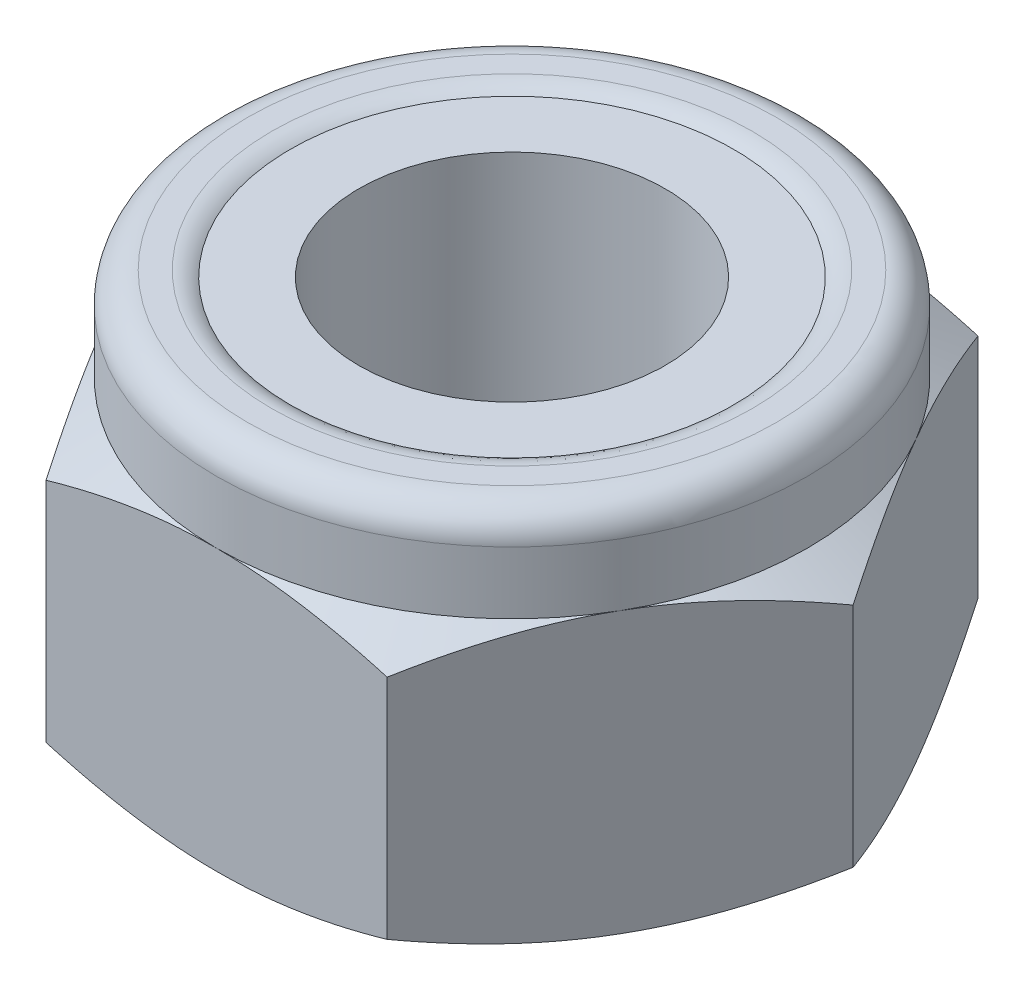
ISO-10303-21;
HEADER;
FILE_DESCRIPTION(('STEP AP214'),'2;1');
FILE_NAME('part.step','',(''),(''),'','','');
FILE_SCHEMA(('AUTOMOTIVE_DESIGN { 1 0 10303 214 1 1 1 1 }'));
ENDSEC;
DATA;
#1=APPLICATION_CONTEXT('core data for automotive mechanical design processes');
#2=APPLICATION_PROTOCOL_DEFINITION('international standard','automotive_design',2000,#1);
#3=PRODUCT_CONTEXT('',#1,'mechanical');
#4=PRODUCT('Part','Part','',(#3));
#5=PRODUCT_RELATED_PRODUCT_CATEGORY('part','',(#4));
#6=PRODUCT_DEFINITION_FORMATION('','',#4);
#7=PRODUCT_DEFINITION_CONTEXT('part definition',#1,'design');
#8=PRODUCT_DEFINITION('design','',#6,#7);
#9=PRODUCT_DEFINITION_SHAPE('','',#8);
#10=(LENGTH_UNIT() NAMED_UNIT(*) SI_UNIT(.MILLI.,.METRE.));
#11=(NAMED_UNIT(*) PLANE_ANGLE_UNIT() SI_UNIT($,.RADIAN.));
#12=(NAMED_UNIT(*) SI_UNIT($,.STERADIAN.) SOLID_ANGLE_UNIT());
#13=UNCERTAINTY_MEASURE_WITH_UNIT(LENGTH_MEASURE(1.E-05),#10,'distance_accuracy_value','');
#14=(GEOMETRIC_REPRESENTATION_CONTEXT(3) GLOBAL_UNCERTAINTY_ASSIGNED_CONTEXT((#13)) GLOBAL_UNIT_ASSIGNED_CONTEXT((#10,
#11,#12)) REPRESENTATION_CONTEXT('',''));
#15=CARTESIAN_POINT('',(0.,0.,0.));
#16=DIRECTION('',(0.,0.,1.));
#17=DIRECTION('',(1.,0.,0.));
#18=AXIS2_PLACEMENT_3D('',#15,#16,#17);
#19=CARTESIAN_POINT('',(5.48482755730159,8.99999999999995,9.50000000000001));
#20=DIRECTION('',(-0.866025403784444,0.,-0.500000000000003));
#21=DIRECTION('',(-0.500000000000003,0.,0.866025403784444));
#22=AXIS2_PLACEMENT_3D('',#19,#20,#21);
#23=PLANE('',#22);
#24=CARTESIAN_POINT('',(10.9697705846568,0.848572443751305,-0.000200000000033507));
#25=CARTESIAN_POINT('',(10.8492020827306,0.77897343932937,0.208630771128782));
#26=CARTESIAN_POINT('',(10.7281840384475,0.71253330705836,0.418240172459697));
#27=CARTESIAN_POINT('',(10.4851774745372,0.58684728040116,0.83913988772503));
#28=CARTESIAN_POINT('',(10.3631886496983,0.527603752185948,1.05043073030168));
#29=CARTESIAN_POINT('',(9.99525656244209,0.361814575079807,1.68770779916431));
#30=CARTESIAN_POINT('',(9.7478608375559,0.267514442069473,2.11620976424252));
#31=CARTESIAN_POINT('',(9.37764446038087,0.15693870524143,2.75744333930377));
#32=CARTESIAN_POINT('',(9.25592985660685,0.125439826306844,2.96825921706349));
#33=CARTESIAN_POINT('',(9.01193711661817,0.0726182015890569,3.39086703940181));
#34=CARTESIAN_POINT('',(8.88965896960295,0.051295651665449,3.60265900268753));
#35=CARTESIAN_POINT('',(8.64489870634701,0.0193730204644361,4.0265962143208));
#36=CARTESIAN_POINT('',(8.52241700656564,0.00876019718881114,4.23874074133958));
#37=CARTESIAN_POINT('',(8.27734047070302,-0.00151746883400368,4.66322575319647));
#38=CARTESIAN_POINT('',(8.15474563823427,-0.00118264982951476,4.87556623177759));
#39=CARTESIAN_POINT('',(7.9255515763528,0.00967336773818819,5.27254199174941));
#40=CARTESIAN_POINT('',(7.81893617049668,0.0188702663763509,5.45720529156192));
#41=CARTESIAN_POINT('',(7.60595470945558,0.0453653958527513,5.82610000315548));
#42=CARTESIAN_POINT('',(7.49958867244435,0.062664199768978,6.01033138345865));
#43=CARTESIAN_POINT('',(7.18090270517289,0.12630448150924,6.56231167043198));
#44=CARTESIAN_POINT('',(6.96914687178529,0.184381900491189,6.92908353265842));
#45=CARTESIAN_POINT('',(6.54338898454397,0.3295760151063,7.6665178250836));
#46=CARTESIAN_POINT('',(6.32944126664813,0.417308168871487,8.03708614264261));
#47=CARTESIAN_POINT('',(5.90473630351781,0.616423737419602,8.77269671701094));
#48=CARTESIAN_POINT('',(5.69397361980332,0.727760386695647,9.13774839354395));
#49=CARTESIAN_POINT('',(5.48471208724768,0.848572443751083,9.50019999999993));
#50=B_SPLINE_CURVE_WITH_KNOTS('',3,(#24,#25,#26,#27,#28,#29,#30,#31,#32,#33,#34,#35,#36,#37,#38,
#39,#40,#41,#42,#43,#44,#45,#46,#47,#48,#49),.UNSPECIFIED.,.F.,.F.,(4,2,2,2,2,2,2,2,2,2,2,2,4),
(0.,0.752880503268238,1.50600787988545,3.01546870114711,3.75167336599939,4.48789219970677,
5.22323407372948,5.95855322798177,6.59868084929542,7.23885375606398,8.52010929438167,
9.82978009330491,11.1368800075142),.UNSPECIFIED.);
#51=CARTESIAN_POINT('',(10.9696551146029,0.84850577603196,0.));
#52=VERTEX_POINT('',#51);
#53=CARTESIAN_POINT('',(8.22724133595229,1.11022302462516E-13,4.75));
#54=VERTEX_POINT('',#53);
#55=EDGE_CURVE('E54',#52,#54,#50,.T.);
#56=ORIENTED_EDGE('',*,*,#55,.F.);
#57=DIRECTION('',(0.,-1.,0.));
#58=VECTOR('',#57,1.);
#59=CARTESIAN_POINT('',(10.9696551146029,8.99999999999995,0.));
#60=LINE('',#59,#58);
#61=CARTESIAN_POINT('',(10.969655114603,8.15149422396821,0.));
#62=VERTEX_POINT('',#61);
#63=EDGE_CURVE('E171',#62,#52,#60,.T.);
#64=ORIENTED_EDGE('',*,*,#63,.F.);
#65=CARTESIAN_POINT('',(5.48471208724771,8.15142755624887,9.50019999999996));
#66=CARTESIAN_POINT('',(5.60528058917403,8.22102656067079,9.29136922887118));
#67=CARTESIAN_POINT('',(5.72629863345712,8.2874666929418,9.08175982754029));
#68=CARTESIAN_POINT('',(5.9693051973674,8.413152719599,8.66086011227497));
#69=CARTESIAN_POINT('',(6.09129402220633,8.47239624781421,8.44956926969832));
#70=CARTESIAN_POINT('',(6.45922610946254,8.63818542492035,7.81229220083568));
#71=CARTESIAN_POINT('',(6.70662183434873,8.73248555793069,7.38379023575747));
#72=CARTESIAN_POINT('',(7.07683821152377,8.84306129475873,6.74255666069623));
#73=CARTESIAN_POINT('',(7.19855281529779,8.87456017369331,6.53174078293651));
#74=CARTESIAN_POINT('',(7.44254555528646,8.9273817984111,6.10913296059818));
#75=CARTESIAN_POINT('',(7.56482370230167,8.94870434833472,5.89734099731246));
#76=CARTESIAN_POINT('',(7.80958396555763,8.98062697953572,5.47340378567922));
#77=CARTESIAN_POINT('',(7.93206566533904,8.99123980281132,5.26125925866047));
#78=CARTESIAN_POINT('',(8.17714220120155,9.00151746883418,4.83677424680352));
#79=CARTESIAN_POINT('',(8.29973703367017,9.00118264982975,4.62443376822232));
#80=CARTESIAN_POINT('',(8.52893109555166,8.99032663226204,4.22745800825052));
#81=CARTESIAN_POINT('',(8.63554650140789,8.98112973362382,4.04279470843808));
#82=CARTESIAN_POINT('',(8.84852796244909,8.95463460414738,3.67389999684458));
#83=CARTESIAN_POINT('',(8.95489399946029,8.93733580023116,3.48966861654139));
#84=CARTESIAN_POINT('',(9.2735799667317,8.87369551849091,2.93768832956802));
#85=CARTESIAN_POINT('',(9.48533580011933,8.81561809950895,2.57091646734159));
#86=CARTESIAN_POINT('',(9.91109368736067,8.67042398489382,1.83348217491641));
#87=CARTESIAN_POINT('',(10.1250414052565,8.58269183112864,1.46291385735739));
#88=CARTESIAN_POINT('',(10.5497463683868,8.38357626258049,0.727303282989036));
#89=CARTESIAN_POINT('',(10.7605090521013,8.2722396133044,0.362251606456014));
#90=CARTESIAN_POINT('',(10.9697705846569,8.15142755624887,-0.000199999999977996));
#91=B_SPLINE_CURVE_WITH_KNOTS('',3,(#65,#66,#67,#68,#69,#70,#71,#72,#73,#74,#75,#76,#77,#78,#79,
#80,#81,#82,#83,#84,#85,#86,#87,#88,#89,#90),.UNSPECIFIED.,.F.,.F.,(4,2,2,2,2,2,2,2,2,2,2,2,4),
(0.,0.752880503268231,1.50600787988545,3.0154687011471,3.75167336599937,4.48789219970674,
5.22323407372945,5.95855322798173,6.59868084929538,7.23885375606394,8.52010929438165,
9.82978009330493,11.1368800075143),.UNSPECIFIED.);
#92=CARTESIAN_POINT('',(8.22724133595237,9.00000000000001,4.74999999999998));
#93=VERTEX_POINT('',#92);
#94=EDGE_CURVE('E261',#93,#62,#91,.T.);
#95=ORIENTED_EDGE('',*,*,#94,.F.);
#96=CARTESIAN_POINT('',(5.48482755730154,8.15149422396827,9.49999999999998));
#97=VERTEX_POINT('',#96);
#98=EDGE_CURVE('E267',#97,#93,#91,.T.);
#99=ORIENTED_EDGE('',*,*,#98,.F.);
#100=DIRECTION('',(0.,-1.,0.));
#101=VECTOR('',#100,1.);
#102=CARTESIAN_POINT('',(5.48482755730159,8.99999999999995,9.50000000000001));
#103=LINE('',#102,#101);
#104=CARTESIAN_POINT('',(5.48482755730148,0.848505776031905,9.49999999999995));
#105=VERTEX_POINT('',#104);
#106=EDGE_CURVE('E157',#97,#105,#103,.T.);
#107=ORIENTED_EDGE('',*,*,#106,.T.);
#108=EDGE_CURVE('E149',#54,#105,#50,.T.);
#109=ORIENTED_EDGE('',*,*,#108,.F.);
#110=EDGE_LOOP('',(#56,#64,#95,#99,#107,#109));
#111=FACE_BOUND('',#110,.T.);
#112=ADVANCED_FACE('F38',(#111),#23,.F.);
#113=CARTESIAN_POINT('',(10.9696551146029,8.99999999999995,0.));
#114=DIRECTION('',(-0.866025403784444,0.,0.500000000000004));
#115=DIRECTION('',(0.500000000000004,0.,0.866025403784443));
#116=AXIS2_PLACEMENT_3D('',#113,#114,#115);
#117=PLANE('',#116);
#118=CARTESIAN_POINT('',(5.48471208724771,0.848572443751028,-9.50020000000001));
#119=CARTESIAN_POINT('',(5.60528058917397,0.778973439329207,-9.29136922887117));
#120=CARTESIAN_POINT('',(5.72629863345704,0.712533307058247,-9.08175982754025));
#121=CARTESIAN_POINT('',(5.9693051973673,0.586847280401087,-8.66086011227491));
#122=CARTESIAN_POINT('',(6.09129402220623,0.527603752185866,-8.44956926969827));
#123=CARTESIAN_POINT('',(6.45922610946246,0.361814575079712,-7.81229220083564));
#124=CARTESIAN_POINT('',(6.70662183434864,0.26751444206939,-7.38379023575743));
#125=CARTESIAN_POINT('',(7.07683821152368,0.156938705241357,-6.74255666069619));
#126=CARTESIAN_POINT('',(7.19855281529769,0.125439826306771,-6.53174078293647));
#127=CARTESIAN_POINT('',(7.44254555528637,0.0726182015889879,-6.10913296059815));
#128=CARTESIAN_POINT('',(7.56482370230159,0.0512956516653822,-5.89734099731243));
#129=CARTESIAN_POINT('',(7.80958396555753,0.0193730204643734,-5.47340378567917));
#130=CARTESIAN_POINT('',(7.9320656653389,0.00876019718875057,-5.26125925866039));
#131=CARTESIAN_POINT('',(8.17714220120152,-0.00151746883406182,-4.8367742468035));
#132=CARTESIAN_POINT('',(8.29973703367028,-0.00118264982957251,-4.62443376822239));
#133=CARTESIAN_POINT('',(8.52893109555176,0.00967336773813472,-4.22745800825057));
#134=CARTESIAN_POINT('',(8.63554650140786,0.018870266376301,-4.04279470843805));
#135=CARTESIAN_POINT('',(8.84852796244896,0.0453653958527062,-3.67389999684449));
#136=CARTESIAN_POINT('',(8.9548939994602,0.0626641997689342,-3.48966861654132));
#137=CARTESIAN_POINT('',(9.27357996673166,0.126304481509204,-2.93768832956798));
#138=CARTESIAN_POINT('',(9.48533580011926,0.184381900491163,-2.57091646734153));
#139=CARTESIAN_POINT('',(9.91109368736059,0.329576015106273,-1.83348217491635));
#140=CARTESIAN_POINT('',(10.1250414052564,0.41730816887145,-1.46291385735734));
#141=CARTESIAN_POINT('',(10.5497463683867,0.616423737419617,-0.727303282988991));
#142=CARTESIAN_POINT('',(10.7605090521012,0.727760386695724,-0.362251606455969));
#143=CARTESIAN_POINT('',(10.9697705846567,0.848572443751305,0.000200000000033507));
#144=B_SPLINE_CURVE_WITH_KNOTS('',3,(#118,#119,#120,#121,#122,#123,#124,#125,#126,#127,#128,
#129,#130,#131,#132,#133,#134,#135,#136,#137,#138,#139,#140,#141,#142,#143),.UNSPECIFIED.,.F.,
.F.,(4,2,2,2,2,2,2,2,2,2,2,2,4),(0.,0.752880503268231,1.50600787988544,3.01546870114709,
3.75167336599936,4.48789219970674,5.22323407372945,5.95855322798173,6.59868084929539,
7.23885375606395,8.52010929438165,9.82978009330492,11.1368800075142),.UNSPECIFIED.);
#145=CARTESIAN_POINT('',(5.48482755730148,0.848505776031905,-9.49999999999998));
#146=VERTEX_POINT('',#145);
#147=CARTESIAN_POINT('',(8.22724133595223,0.,-4.75000000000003));
#148=VERTEX_POINT('',#147);
#149=EDGE_CURVE('E61',#146,#148,#144,.T.);
#150=ORIENTED_EDGE('',*,*,#149,.F.);
#151=DIRECTION('',(0.,-1.,0.));
#152=VECTOR('',#151,1.);
#153=CARTESIAN_POINT('',(5.48482755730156,8.99999999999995,-9.49999999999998));
#154=LINE('',#153,#152);
#155=CARTESIAN_POINT('',(5.48482755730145,8.15149422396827,-9.49999999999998));
#156=VERTEX_POINT('',#155);
#157=EDGE_CURVE('E168',#156,#146,#154,.T.);
#158=ORIENTED_EDGE('',*,*,#157,.F.);
#159=CARTESIAN_POINT('',(10.9697705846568,8.15142755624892,0.000200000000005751));
#160=CARTESIAN_POINT('',(10.8492020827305,8.22102656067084,-0.208630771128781));
#161=CARTESIAN_POINT('',(10.7281840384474,8.28746669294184,-0.418240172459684));
#162=CARTESIAN_POINT('',(10.4851774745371,8.41315271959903,-0.839139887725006));
#163=CARTESIAN_POINT('',(10.3631886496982,8.47239624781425,-1.05043073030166));
#164=CARTESIAN_POINT('',(9.995256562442,8.63818542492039,-1.68770779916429));
#165=CARTESIAN_POINT('',(9.74786083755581,8.73248555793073,-2.11620976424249));
#166=CARTESIAN_POINT('',(9.37764446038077,8.84306129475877,-2.75744333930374));
#167=CARTESIAN_POINT('',(9.25592985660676,8.87456017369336,-2.96825921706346));
#168=CARTESIAN_POINT('',(9.01193711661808,8.92738179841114,-3.39086703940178));
#169=CARTESIAN_POINT('',(8.88965896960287,8.94870434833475,-3.60265900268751));
#170=CARTESIAN_POINT('',(8.64489870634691,8.98062697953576,-4.02659621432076));
#171=CARTESIAN_POINT('',(8.52241700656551,8.99123980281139,-4.23874074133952));
#172=CARTESIAN_POINT('',(8.27734047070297,9.00151746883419,-4.66322575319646));
#173=CARTESIAN_POINT('',(8.1547456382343,9.00118264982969,-4.87556623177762));
#174=CARTESIAN_POINT('',(7.92555157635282,8.99032663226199,-5.27254199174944));
#175=CARTESIAN_POINT('',(7.81893617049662,8.98112973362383,-5.45720529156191));
#176=CARTESIAN_POINT('',(7.60595470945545,8.95463460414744,-5.82610000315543));
#177=CARTESIAN_POINT('',(7.49958867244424,8.9373358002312,-6.01033138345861));
#178=CARTESIAN_POINT('',(7.18090270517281,8.87369551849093,-6.56231167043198));
#179=CARTESIAN_POINT('',(6.96914687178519,8.81561809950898,-6.92908353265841));
#180=CARTESIAN_POINT('',(6.54338898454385,8.67042398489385,-7.66651782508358));
#181=CARTESIAN_POINT('',(6.329441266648,8.58269183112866,-8.0370861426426));
#182=CARTESIAN_POINT('',(5.90473630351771,8.38357626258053,-8.77269671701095));
#183=CARTESIAN_POINT('',(5.69397361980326,8.27223961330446,-9.13774839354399));
#184=CARTESIAN_POINT('',(5.48471208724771,8.15142755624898,-9.50020000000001));
#185=B_SPLINE_CURVE_WITH_KNOTS('',3,(#159,#160,#161,#162,#163,#164,#165,#166,#167,#168,#169,
#170,#171,#172,#173,#174,#175,#176,#177,#178,#179,#180,#181,#182,#183,#184),.UNSPECIFIED.,.F.,
.F.,(4,2,2,2,2,2,2,2,2,2,2,2,4),(0.,0.752880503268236,1.50600787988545,3.0154687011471,
3.75167336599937,4.48789219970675,5.22323407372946,5.95855322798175,6.59868084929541,
7.23885375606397,8.52010929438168,9.82978009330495,11.1368800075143),.UNSPECIFIED.);
#186=CARTESIAN_POINT('',(8.22724133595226,8.99999999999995,-4.75));
#187=VERTEX_POINT('',#186);
#188=EDGE_CURVE('E269',#187,#156,#185,.T.);
#189=ORIENTED_EDGE('',*,*,#188,.F.);
#190=EDGE_CURVE('E268',#62,#187,#185,.T.);
#191=ORIENTED_EDGE('',*,*,#190,.F.);
#192=ORIENTED_EDGE('',*,*,#63,.T.);
#193=EDGE_CURVE('E196',#148,#52,#144,.T.);
#194=ORIENTED_EDGE('',*,*,#193,.F.);
#195=EDGE_LOOP('',(#150,#158,#189,#191,#192,#194));
#196=FACE_BOUND('',#195,.T.);
#197=ADVANCED_FACE('F203',(#196),#117,.F.);
#198=CARTESIAN_POINT('',(5.48482755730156,8.99999999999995,-9.49999999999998));
#199=DIRECTION('',(0.,0.,1.00000000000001));
#200=DIRECTION('',(1.00000000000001,0.,0.));
#201=AXIS2_PLACEMENT_3D('',#198,#199,#200);
#202=PLANE('',#201);
#203=CARTESIAN_POINT('',(-14.741862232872,4.64059427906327,-9.50000000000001));
#204=CARTESIAN_POINT('',(-14.5343078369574,4.53986834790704,-9.49999999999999));
#205=CARTESIAN_POINT('',(-14.3265100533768,4.43964416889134,-9.49999999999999));
#206=CARTESIAN_POINT('',(-13.9103769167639,4.24031297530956,-9.49999999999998));
#207=CARTESIAN_POINT('',(-13.7020415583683,4.14120597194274,-9.49999999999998));
#208=CARTESIAN_POINT('',(-13.0760974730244,3.84570510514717,-9.49999999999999));
#209=CARTESIAN_POINT('',(-12.6576120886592,3.65116124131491,-9.49999999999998));
#210=CARTESIAN_POINT('',(-11.8155707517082,3.26713746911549,-9.49999999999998));
#211=CARTESIAN_POINT('',(-11.3919996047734,3.07769079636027,-9.49999999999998));
#212=CARTESIAN_POINT('',(-10.5414907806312,2.70653921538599,-9.49999999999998));
#213=CARTESIAN_POINT('',(-10.1145532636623,2.52483394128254,-9.49999999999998));
#214=CARTESIAN_POINT('',(-9.24306841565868,2.16562399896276,-9.49999999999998));
#215=CARTESIAN_POINT('',(-8.79839089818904,1.9884334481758,-9.49999999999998));
#216=CARTESIAN_POINT('',(-7.90383869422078,1.64744090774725,-9.49999999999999));
#217=CARTESIAN_POINT('',(-7.45396343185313,1.48364041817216,-9.49999999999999));
#218=CARTESIAN_POINT('',(-6.54913236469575,1.17372041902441,-9.49999999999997));
#219=CARTESIAN_POINT('',(-6.09418890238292,1.02756526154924,-9.49999999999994));
#220=CARTESIAN_POINT('',(-5.17779400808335,0.757616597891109,-9.50000000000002));
#221=CARTESIAN_POINT('',(-4.71634467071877,0.63381606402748,-9.50000000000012));
#222=CARTESIAN_POINT('',(-3.78903235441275,0.415145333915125,-9.50000000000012));
#223=CARTESIAN_POINT('',(-3.32320559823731,0.320125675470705,-9.50000000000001));
#224=CARTESIAN_POINT('',(-2.62021777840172,0.203320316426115,-9.49999999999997));
#225=CARTESIAN_POINT('',(-2.38516411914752,0.168671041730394,-9.49999999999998));
#226=CARTESIAN_POINT('',(-1.91388541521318,0.108626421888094,-9.49999999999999));
#227=CARTESIAN_POINT('',(-1.67766048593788,0.0832301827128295,-9.49999999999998));
#228=CARTESIAN_POINT('',(-1.20744715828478,0.0425167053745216,-9.49999999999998));
#229=CARTESIAN_POINT('',(-0.973469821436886,0.0270722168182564,-9.49999999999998));
#230=CARTESIAN_POINT('',(-0.505071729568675,0.00609177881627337,-9.49999999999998));
#231=CARTESIAN_POINT('',(-0.270650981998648,0.000555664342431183,-9.49999999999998));
#232=CARTESIAN_POINT('',(0.198218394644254,-0.000475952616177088,-9.49999999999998));
#233=CARTESIAN_POINT('',(0.43266702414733,0.00402872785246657,-9.49999999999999));
#234=CARTESIAN_POINT('',(0.901165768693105,0.0229688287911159,-9.49999999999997));
#235=CARTESIAN_POINT('',(1.13521586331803,0.0374047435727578,-9.49999999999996));
#236=CARTESIAN_POINT('',(1.69723363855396,0.0836877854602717,-9.49999999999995));
#237=CARTESIAN_POINT('',(2.02482362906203,0.120220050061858,-9.49999999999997));
#238=CARTESIAN_POINT('',(2.67756448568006,0.21075098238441,-9.49999999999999));
#239=CARTESIAN_POINT('',(3.00271501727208,0.264752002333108,-9.49999999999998));
#240=CARTESIAN_POINT('',(3.97412178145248,0.450093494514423,-9.49999999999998));
#241=CARTESIAN_POINT('',(4.61598956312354,0.604740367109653,-9.49999999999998));
#242=CARTESIAN_POINT('',(5.57617496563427,0.872916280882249,-9.49999999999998));
#243=CARTESIAN_POINT('',(5.89946609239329,0.969660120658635,-9.49999999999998));
#244=CARTESIAN_POINT('',(6.54290603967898,1.17318038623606,-9.49999999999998));
#245=CARTESIAN_POINT('',(6.86305483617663,1.27995688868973,-9.49999999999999));
#246=CARTESIAN_POINT('',(7.50031751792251,1.50182992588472,-9.49999999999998));
#247=CARTESIAN_POINT('',(7.81743231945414,1.61692385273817,-9.49999999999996));
#248=CARTESIAN_POINT('',(8.4490292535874,1.85407859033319,-9.5));
#249=CARTESIAN_POINT('',(8.76351144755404,1.97613923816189,-9.50000000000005));
#250=CARTESIAN_POINT('',(9.62249906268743,2.31872617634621,-9.50000000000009));
#251=CARTESIAN_POINT('',(10.1646500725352,2.5451505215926,-9.50000000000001));
#252=CARTESIAN_POINT('',(11.2433728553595,3.01096661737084,-9.49999999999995));
#253=CARTESIAN_POINT('',(11.7799439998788,3.2503598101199,-9.49999999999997));
#254=CARTESIAN_POINT('',(12.848824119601,3.73897742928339,-9.49999999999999));
#255=CARTESIAN_POINT('',(13.3811313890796,3.9882055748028,-9.49999999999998));
#256=CARTESIAN_POINT('',(14.4421631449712,4.49409481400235,-9.49999999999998));
#257=CARTESIAN_POINT('',(14.9708877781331,4.75075560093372,-9.49999999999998));
#258=CARTESIAN_POINT('',(16.0263168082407,5.27027525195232,-9.49999999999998));
#259=CARTESIAN_POINT('',(16.5530166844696,5.53314328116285,-9.49999999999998));
#260=CARTESIAN_POINT('',(17.6041039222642,6.06346616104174,-9.49999999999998));
#261=CARTESIAN_POINT('',(18.1284912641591,6.33092105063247,-9.49999999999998));
#262=CARTESIAN_POINT('',(19.1752585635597,6.86944487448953,-9.49999999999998));
#263=CARTESIAN_POINT('',(19.6976389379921,7.14051299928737,-9.49999999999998));
#264=CARTESIAN_POINT('',(20.7408397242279,7.68563617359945,-9.49999999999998));
#265=CARTESIAN_POINT('',(21.2616601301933,7.95969123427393,-9.49999999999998));
#266=CARTESIAN_POINT('',(22.7101699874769,8.72624211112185,-9.49999999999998));
#267=CARTESIAN_POINT('',(23.6364473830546,9.22140564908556,-9.49999999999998));
#268=CARTESIAN_POINT('',(25.4860332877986,10.2173706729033,-9.49999999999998));
#269=CARTESIAN_POINT('',(26.4093416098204,10.7181725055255,-9.49999999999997));
#270=CARTESIAN_POINT('',(28.2506680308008,11.7223337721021,-9.49999999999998));
#271=CARTESIAN_POINT('',(29.1686935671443,12.2256795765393,-9.49999999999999));
#272=CARTESIAN_POINT('',(30.5443770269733,12.9830727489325,-9.49999999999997));
#273=CARTESIAN_POINT('',(31.0026947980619,13.2359231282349,-9.49999999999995));
#274=CARTESIAN_POINT('',(31.9189378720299,13.7423328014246,-9.5));
#275=CARTESIAN_POINT('',(32.3768631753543,13.9958920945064,-9.50000000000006));
#276=CARTESIAN_POINT('',(32.8346164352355,14.2497616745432,-9.5000000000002));
#277=B_SPLINE_CURVE_WITH_KNOTS('',3,(#203,#204,#205,#206,#207,#208,#209,#210,#211,#212,#213,
#214,#215,#216,#217,#218,#219,#220,#221,#222,#223,#224,#225,#226,#227,#228,#229,#230,#231,#232,
#233,#234,#235,#236,#237,#238,#239,#240,#241,#242,#243,#244,#245,#246,#247,#248,#249,#250,#251,
#252,#253,#254,#255,#256,#257,#258,#259,#260,#261,#262,#263,#264,#265,#266,#267,#268,#269,#270,
#271,#272,#273,#274,#275,#276),.UNSPECIFIED.,.F.,.F.,(4,2,2,2,2,2,2,2,2,2,2,2,2,2,2,2,2,2,2,2,2,
2,2,2,2,2,2,2,2,2,2,2,2,2,2,2,4),(0.,0.692112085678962,1.38423110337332,2.768673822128,
4.1606344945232,5.5525293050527,6.98840219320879,8.42443572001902,9.85751775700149,
11.2901484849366,12.7152065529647,13.4278343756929,14.1403933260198,14.8436500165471,
15.5468949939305,16.2501527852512,16.95344558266,17.9417501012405,18.9301877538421,
20.9080937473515,21.9203768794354,22.932667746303,23.9446425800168,24.9565937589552,
26.7189381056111,28.4814788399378,30.2446925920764,32.0078336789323,33.7737647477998,
35.539710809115,37.3052676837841,39.0708311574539,42.2217673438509,45.3728983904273,
48.5137733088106,50.0840901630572,51.6544052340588),.UNSPECIFIED.);
#278=CARTESIAN_POINT('',(-5.48482755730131,0.848505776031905,-9.50000000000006));
#279=VERTEX_POINT('',#278);
#280=CARTESIAN_POINT('',(0.,0.,-9.50000000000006));
#281=VERTEX_POINT('',#280);
#282=EDGE_CURVE('E344',#279,#281,#277,.T.);
#283=ORIENTED_EDGE('',*,*,#282,.F.);
#284=DIRECTION('',(0.,-1.,0.));
#285=VECTOR('',#284,1.);
#286=CARTESIAN_POINT('',(-5.4848275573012,8.9999999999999,-9.50000000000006));
#287=LINE('',#286,#285);
#288=CARTESIAN_POINT('',(-5.4848275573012,8.15149422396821,-9.50000000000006));
#289=VERTEX_POINT('',#288);
#290=EDGE_CURVE('E159',#289,#279,#287,.T.);
#291=ORIENTED_EDGE('',*,*,#290,.F.);
#292=CARTESIAN_POINT('',(-14.9062570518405,4.27949399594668,-9.50000000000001));
#293=CARTESIAN_POINT('',(-14.6980308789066,4.38087278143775,-9.49999999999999));
#294=CARTESIAN_POINT('',(-14.4895649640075,4.48175892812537,-9.49999999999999));
#295=CARTESIAN_POINT('',(-14.0721036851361,4.68243468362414,-9.49999999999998));
#296=CARTESIAN_POINT('',(-13.8631083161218,4.78222428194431,-9.49999999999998));
#297=CARTESIAN_POINT('',(-13.2351997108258,5.07980659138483,-9.49999999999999));
#298=CARTESIAN_POINT('',(-12.8154229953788,5.27578400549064,-9.49999999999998));
#299=CARTESIAN_POINT('',(-11.9709152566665,5.66276315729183,-9.49999999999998));
#300=CARTESIAN_POINT('',(-11.5461698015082,5.85373347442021,-9.49999999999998));
#301=CARTESIAN_POINT('',(-10.6933608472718,6.22808851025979,-9.49999999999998));
#302=CARTESIAN_POINT('',(-10.265297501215,6.41147357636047,-9.49999999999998));
#303=CARTESIAN_POINT('',(-9.39081535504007,6.77461763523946,-9.49999999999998));
#304=CARTESIAN_POINT('',(-8.94426075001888,6.95405134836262,-9.49999999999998));
#305=CARTESIAN_POINT('',(-8.04599301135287,7.29975377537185,-9.49999999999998));
#306=CARTESIAN_POINT('',(-7.59427931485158,7.46602103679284,-9.49999999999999));
#307=CARTESIAN_POINT('',(-6.68575951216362,7.781152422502,-9.49999999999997));
#308=CARTESIAN_POINT('',(-6.22896523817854,7.93005030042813,-9.49999999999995));
#309=CARTESIAN_POINT('',(-5.30884281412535,8.2057821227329,-9.50000000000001));
#310=CARTESIAN_POINT('',(-4.84551671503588,8.33262283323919,-9.5000000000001));
#311=CARTESIAN_POINT('',(-3.91453959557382,8.55759278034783,-9.50000000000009));
#312=CARTESIAN_POINT('',(-3.44692793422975,8.6558805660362,-9.5));
#313=CARTESIAN_POINT('',(-2.74111749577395,8.77771984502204,-9.49999999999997));
#314=CARTESIAN_POINT('',(-2.50509949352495,8.81406909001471,-9.49999999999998));
#315=CARTESIAN_POINT('',(-2.03183235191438,8.87752841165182,-9.49999999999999));
#316=CARTESIAN_POINT('',(-1.79458333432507,8.90463938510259,-9.49999999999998));
#317=CARTESIAN_POINT('',(-1.32234832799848,8.94873258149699,-9.49999999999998));
#318=CARTESIAN_POINT('',(-1.08737460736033,8.96584564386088,-9.49999999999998));
#319=CARTESIAN_POINT('',(-0.616913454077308,8.99011197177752,-9.49999999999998));
#320=CARTESIAN_POINT('',(-0.381426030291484,8.9972654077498,-9.49999999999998));
#321=CARTESIAN_POINT('',(0.0896422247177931,9.00144113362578,-9.49999999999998));
#322=CARTESIAN_POINT('',(0.325223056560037,8.99846335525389,-9.49999999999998));
#323=CARTESIAN_POINT('',(0.796045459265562,8.98245141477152,-9.49999999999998));
#324=CARTESIAN_POINT('',(1.03128701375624,8.96941678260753,-9.49999999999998));
#325=CARTESIAN_POINT('',(1.5913721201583,8.92669048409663,-9.49999999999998));
#326=CARTESIAN_POINT('',(1.91588174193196,8.89252067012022,-9.49999999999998));
#327=CARTESIAN_POINT('',(2.56259063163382,8.80686803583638,-9.49999999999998));
#328=CARTESIAN_POINT('',(2.88478960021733,8.75538301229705,-9.49999999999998));
#329=CARTESIAN_POINT('',(3.84748783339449,8.57767719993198,-9.49999999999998));
#330=CARTESIAN_POINT('',(4.48376264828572,8.4282338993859,-9.49999999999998));
#331=CARTESIAN_POINT('',(5.43560491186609,8.16778244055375,-9.49999999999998));
#332=CARTESIAN_POINT('',(5.75607090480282,8.07363614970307,-9.49999999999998));
#333=CARTESIAN_POINT('',(6.39389267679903,7.87524562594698,-9.49999999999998));
#334=CARTESIAN_POINT('',(6.71124843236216,7.77100131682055,-9.49999999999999));
#335=CARTESIAN_POINT('',(7.34294682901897,7.55411393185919,-9.49999999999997));
#336=CARTESIAN_POINT('',(7.65729031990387,7.44147330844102,-9.49999999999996));
#337=CARTESIAN_POINT('',(8.28334825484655,7.20915066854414,-9.50000000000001));
#338=CARTESIAN_POINT('',(8.59506275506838,7.08946880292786,-9.50000000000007));
#339=CARTESIAN_POINT('',(9.42222852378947,6.7628686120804,-9.50000000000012));
#340=CARTESIAN_POINT('',(9.93562767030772,6.55075831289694,-9.50000000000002));
#341=CARTESIAN_POINT('',(10.957249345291,6.11437483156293,-9.49999999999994));
#342=CARTESIAN_POINT('',(11.4654713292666,5.89010038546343,-9.49999999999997));
#343=CARTESIAN_POINT('',(12.4779028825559,5.43222094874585,-9.49999999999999));
#344=CARTESIAN_POINT('',(12.9821109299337,5.19861260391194,-9.49999999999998));
#345=CARTESIAN_POINT('',(13.9871249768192,4.72426075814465,-9.49999999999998));
#346=CARTESIAN_POINT('',(14.4879311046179,4.48351752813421,-9.49999999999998));
#347=CARTESIAN_POINT('',(15.487574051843,3.99605128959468,-9.49999999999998));
#348=CARTESIAN_POINT('',(15.9864066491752,3.7493196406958,-9.49999999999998));
#349=CARTESIAN_POINT('',(16.9818341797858,3.25138083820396,-9.49999999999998));
#350=CARTESIAN_POINT('',(17.478429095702,3.00017364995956,-9.49999999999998));
#351=CARTESIAN_POINT('',(18.4696714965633,2.49420414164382,-9.49999999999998));
#352=CARTESIAN_POINT('',(18.9643193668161,2.23944257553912,-9.49999999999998));
#353=CARTESIAN_POINT('',(19.9520852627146,1.72696908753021,-9.49999999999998));
#354=CARTESIAN_POINT('',(20.4452032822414,1.46925715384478,-9.49999999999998));
#355=CARTESIAN_POINT('',(21.8209047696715,0.745975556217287,-9.49999999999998));
#356=CARTESIAN_POINT('',(22.7020755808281,0.277719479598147,-9.49999999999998));
#357=CARTESIAN_POINT('',(24.4614329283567,-0.664474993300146,-9.49999999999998));
#358=CARTESIAN_POINT('',(25.3396192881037,-1.13841371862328,-9.49999999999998));
#359=CARTESIAN_POINT('',(27.0908390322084,-2.08899603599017,-9.49999999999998));
#360=CARTESIAN_POINT('',(27.9638798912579,-2.56562586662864,-9.49999999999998));
#361=CARTESIAN_POINT('',(29.2720720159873,-3.28298695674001,-9.49999999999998));
#362=CARTESIAN_POINT('',(29.7078916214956,-3.52250105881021,-9.49999999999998));
#363=CARTESIAN_POINT('',(30.5791326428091,-4.00225113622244,-9.49999999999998));
#364=CARTESIAN_POINT('',(31.0145540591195,-4.24248711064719,-9.49999999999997));
#365=CARTESIAN_POINT('',(31.4498005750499,-4.4830396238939,-9.49999999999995));
#366=B_SPLINE_CURVE_WITH_KNOTS('',3,(#292,#293,#294,#295,#296,#297,#298,#299,#300,#301,#302,
#303,#304,#305,#306,#307,#308,#309,#310,#311,#312,#313,#314,#315,#316,#317,#318,#319,#320,#321,
#322,#323,#324,#325,#326,#327,#328,#329,#330,#331,#332,#333,#334,#335,#336,#337,#338,#339,#340,
#341,#342,#343,#344,#345,#346,#347,#348,#349,#350,#351,#352,#353,#354,#355,#356,#357,#358,#359,
#360,#361,#362,#363,#364,#365),.UNSPECIFIED.,.F.,.F.,(4,2,2,2,2,2,2,2,2,2,2,2,2,2,2,2,2,2,2,2,2,
2,2,2,2,2,2,2,2,2,2,2,2,2,2,2,4),(0.,0.694780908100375,1.38956845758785,2.77934057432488,
4.17638856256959,5.57337249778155,7.01697976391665,8.46074606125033,9.90165824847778,
11.3421276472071,12.7744384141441,13.4906882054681,14.2068684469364,14.9134532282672,
15.6200259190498,16.3266033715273,17.0332138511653,18.0115758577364,18.9900624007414,
20.9480120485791,21.9499504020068,22.9518963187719,23.9535507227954,24.9551836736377,
26.6214224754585,28.2878347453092,29.9548513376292,31.6218047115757,33.2913259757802,
34.9608601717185,36.6300454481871,38.2992373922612,41.2927868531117,44.2865104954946,
47.2705228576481,48.7624176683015,50.2543105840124),.UNSPECIFIED.);
#367=CARTESIAN_POINT('',(2.4980018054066E-13,8.99999999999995,-9.50000000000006));
#368=VERTEX_POINT('',#367);
#369=EDGE_CURVE('E306',#368,#289,#366,.F.);
#370=ORIENTED_EDGE('',*,*,#369,.F.);
#371=EDGE_CURVE('E309',#156,#368,#366,.F.);
#372=ORIENTED_EDGE('',*,*,#371,.F.);
#373=ORIENTED_EDGE('',*,*,#157,.T.);
#374=EDGE_CURVE('E222',#281,#146,#277,.T.);
#375=ORIENTED_EDGE('',*,*,#374,.F.);
#376=EDGE_LOOP('',(#283,#291,#370,#372,#373,#375));
#377=FACE_BOUND('',#376,.T.);
#378=ADVANCED_FACE('F308',(#377),#202,.F.);
#379=CARTESIAN_POINT('',(-5.4848275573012,8.9999999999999,-9.50000000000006));
#380=DIRECTION('',(0.866025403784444,0.,0.500000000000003));
#381=DIRECTION('',(0.500000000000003,0.,-0.866025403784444));
#382=AXIS2_PLACEMENT_3D('',#379,#380,#381);
#383=PLANE('',#382);
#384=CARTESIAN_POINT('',(-10.9697705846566,0.848572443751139,0.000200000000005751));
#385=CARTESIAN_POINT('',(-10.8492020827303,0.77897343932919,-0.208630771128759));
#386=CARTESIAN_POINT('',(-10.7281840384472,0.712533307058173,-0.418240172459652));
#387=CARTESIAN_POINT('',(-10.4851774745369,0.586847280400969,-0.839139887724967));
#388=CARTESIAN_POINT('',(-10.363188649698,0.527603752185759,-1.05043073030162));
#389=CARTESIAN_POINT('',(-9.99525656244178,0.361814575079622,-1.68770779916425));
#390=CARTESIAN_POINT('',(-9.7478608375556,0.267514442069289,-2.11620976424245));
#391=CARTESIAN_POINT('',(-9.37764446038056,0.156938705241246,-2.75744333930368));
#392=CARTESIAN_POINT('',(-9.25592985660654,0.125439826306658,-2.9682592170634));
#393=CARTESIAN_POINT('',(-9.01193711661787,0.0726182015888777,-3.39086703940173));
#394=CARTESIAN_POINT('',(-8.88965896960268,0.0512956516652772,-3.60265900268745));
#395=CARTESIAN_POINT('',(-8.64489870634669,0.0193730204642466,-4.02659621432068));
#396=CARTESIAN_POINT('',(-8.52241700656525,0.00876019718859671,-4.23874074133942));
#397=CARTESIAN_POINT('',(-8.27734047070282,-0.00151746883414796,-4.66322575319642));
#398=CARTESIAN_POINT('',(-8.15474563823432,-0.00118264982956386,-4.87556623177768));
#399=CARTESIAN_POINT('',(-7.9255515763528,0.00967336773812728,-5.27254199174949));
#400=CARTESIAN_POINT('',(-7.81893617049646,0.0188702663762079,-5.45720529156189));
#401=CARTESIAN_POINT('',(-7.60595470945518,0.0453653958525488,-5.82610000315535));
#402=CARTESIAN_POINT('',(-7.499588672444,0.0626641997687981,-6.01033138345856));
#403=CARTESIAN_POINT('',(-7.18090270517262,0.126304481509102,-6.56231167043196));
#404=CARTESIAN_POINT('',(-6.96914687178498,0.184381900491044,-6.92908353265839));
#405=CARTESIAN_POINT('',(-6.54338898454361,0.329576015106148,-7.66651782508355));
#406=CARTESIAN_POINT('',(-6.32944126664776,0.417308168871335,-8.03708614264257));
#407=CARTESIAN_POINT('',(-5.9047363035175,0.616423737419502,-8.77269671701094));
#408=CARTESIAN_POINT('',(-5.69397361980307,0.7277603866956,-9.137748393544));
#409=CARTESIAN_POINT('',(-5.48471208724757,0.848572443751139,-9.50020000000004));
#410=B_SPLINE_CURVE_WITH_KNOTS('',3,(#384,#385,#386,#387,#388,#389,#390,#391,#392,#393,#394,
#395,#396,#397,#398,#399,#400,#401,#402,#403,#404,#405,#406,#407,#408,#409),.UNSPECIFIED.,.F.,
.F.,(4,2,2,2,2,2,2,2,2,2,2,2,4),(0.,0.752880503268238,1.50600787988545,3.01546870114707,
3.75167336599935,4.48789219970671,5.22323407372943,5.95855322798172,6.59868084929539,
7.23885375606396,8.52010929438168,9.82978009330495,11.1368800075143),.UNSPECIFIED.);
#411=CARTESIAN_POINT('',(-10.9696551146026,0.84850577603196,0.));
#412=VERTEX_POINT('',#411);
#413=CARTESIAN_POINT('',(-8.22724133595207,0.,-4.75000000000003));
#414=VERTEX_POINT('',#413);
#415=EDGE_CURVE('E207',#412,#414,#410,.T.);
#416=ORIENTED_EDGE('',*,*,#415,.F.);
#417=DIRECTION('',(0.,-1.,0.));
#418=VECTOR('',#417,1.);
#419=CARTESIAN_POINT('',(-10.9696551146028,8.99999999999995,0.));
#420=LINE('',#419,#418);
#421=CARTESIAN_POINT('',(-10.9696551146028,8.15149422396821,0.));
#422=VERTEX_POINT('',#421);
#423=EDGE_CURVE('E156',#422,#412,#420,.T.);
#424=ORIENTED_EDGE('',*,*,#423,.F.);
#425=CARTESIAN_POINT('',(-5.48471208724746,8.15142755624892,-9.50020000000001));
#426=CARTESIAN_POINT('',(-5.60528058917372,8.22102656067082,-9.29136922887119));
#427=CARTESIAN_POINT('',(-5.72629863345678,8.28746669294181,-9.08175982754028));
#428=CARTESIAN_POINT('',(-5.96930519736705,8.413152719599,-8.66086011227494));
#429=CARTESIAN_POINT('',(-6.09129402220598,8.47239624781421,-8.4495692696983));
#430=CARTESIAN_POINT('',(-6.4592261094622,8.63818542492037,-7.81229220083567));
#431=CARTESIAN_POINT('',(-6.70662183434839,8.7324855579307,-7.38379023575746));
#432=CARTESIAN_POINT('',(-7.07683821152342,8.84306129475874,-6.74255666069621));
#433=CARTESIAN_POINT('',(-7.19855281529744,8.87456017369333,-6.53174078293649));
#434=CARTESIAN_POINT('',(-7.44254555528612,8.92738179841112,-6.10913296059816));
#435=CARTESIAN_POINT('',(-7.56482370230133,8.94870434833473,-5.89734099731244));
#436=CARTESIAN_POINT('',(-7.80958396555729,8.98062697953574,-5.47340378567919));
#437=CARTESIAN_POINT('',(-7.93206566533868,8.99123980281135,-5.26125925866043));
#438=CARTESIAN_POINT('',(-8.17714220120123,9.00151746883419,-4.8367742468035));
#439=CARTESIAN_POINT('',(-8.29973703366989,9.00118264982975,-4.62443376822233));
#440=CARTESIAN_POINT('',(-8.52893109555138,8.99032663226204,-4.22745800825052));
#441=CARTESIAN_POINT('',(-8.63554650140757,8.98112973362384,-4.04279470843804));
#442=CARTESIAN_POINT('',(-8.84852796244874,8.95463460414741,-3.67389999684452));
#443=CARTESIAN_POINT('',(-8.95489399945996,8.93733580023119,-3.48966861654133));
#444=CARTESIAN_POINT('',(-9.27357996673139,8.87369551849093,-2.93768832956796));
#445=CARTESIAN_POINT('',(-9.48533580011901,8.81561809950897,-2.57091646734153));
#446=CARTESIAN_POINT('',(-9.91109368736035,8.67042398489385,-1.83348217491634));
#447=CARTESIAN_POINT('',(-10.1250414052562,8.58269183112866,-1.46291385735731));
#448=CARTESIAN_POINT('',(-10.5497463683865,8.3835762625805,-0.727303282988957));
#449=CARTESIAN_POINT('',(-10.760509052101,8.27223961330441,-0.362251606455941));
#450=CARTESIAN_POINT('',(-10.9697705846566,8.15142755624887,0.000200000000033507));
#451=B_SPLINE_CURVE_WITH_KNOTS('',3,(#425,#426,#427,#428,#429,#430,#431,#432,#433,#434,#435,
#436,#437,#438,#439,#440,#441,#442,#443,#444,#445,#446,#447,#448,#449,#450),.UNSPECIFIED.,.F.,
.F.,(4,2,2,2,2,2,2,2,2,2,2,2,4),(0.,0.752880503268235,1.50600787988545,3.01546870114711,
3.75167336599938,4.48789219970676,5.22323407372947,5.95855322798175,6.59868084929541,
7.23885375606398,8.5201092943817,9.829780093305,11.1368800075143),.UNSPECIFIED.);
#452=CARTESIAN_POINT('',(-8.22724133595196,8.9999999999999,-4.75000000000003));
#453=VERTEX_POINT('',#452);
#454=EDGE_CURVE('E313',#453,#422,#451,.T.);
#455=ORIENTED_EDGE('',*,*,#454,.F.);
#456=EDGE_CURVE('E312',#289,#453,#451,.T.);
#457=ORIENTED_EDGE('',*,*,#456,.F.);
#458=ORIENTED_EDGE('',*,*,#290,.T.);
#459=EDGE_CURVE('E209',#414,#279,#410,.T.);
#460=ORIENTED_EDGE('',*,*,#459,.F.);
#461=EDGE_LOOP('',(#416,#424,#455,#457,#458,#460));
#462=FACE_BOUND('',#461,.T.);
#463=ADVANCED_FACE('F324',(#462),#383,.F.);
#464=CARTESIAN_POINT('',(-10.9696551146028,8.99999999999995,0.));
#465=DIRECTION('',(0.866025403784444,0.,-0.500000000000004));
#466=DIRECTION('',(-0.500000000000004,0.,-0.866025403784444));
#467=AXIS2_PLACEMENT_3D('',#464,#465,#466);
#468=PLANE('',#467);
#469=CARTESIAN_POINT('',(-5.48471208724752,0.848572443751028,9.50020000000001));
#470=CARTESIAN_POINT('',(-5.60528058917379,0.778973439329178,9.29136922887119));
#471=CARTESIAN_POINT('',(-5.72629863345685,0.712533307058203,9.08175982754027));
#472=CARTESIAN_POINT('',(-5.96930519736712,0.586847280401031,8.66086011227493));
#473=CARTESIAN_POINT('',(-6.09129402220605,0.527603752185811,8.44956926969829));
#474=CARTESIAN_POINT('',(-6.45922610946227,0.361814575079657,7.81229220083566));
#475=CARTESIAN_POINT('',(-6.70662183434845,0.267514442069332,7.38379023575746));
#476=CARTESIAN_POINT('',(-7.07683821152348,0.156938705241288,6.74255666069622));
#477=CARTESIAN_POINT('',(-7.1985528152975,0.125439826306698,6.5317407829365));
#478=CARTESIAN_POINT('',(-7.44254555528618,0.0726182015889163,6.10913296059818));
#479=CARTESIAN_POINT('',(-7.5648237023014,0.0512956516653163,5.89734099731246));
#480=CARTESIAN_POINT('',(-7.80958396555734,0.0193730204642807,5.4734037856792));
#481=CARTESIAN_POINT('',(-7.9320656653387,0.00876019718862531,5.26125925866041));
#482=CARTESIAN_POINT('',(-8.17714220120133,-0.00151746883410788,4.83677424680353));
#483=CARTESIAN_POINT('',(-8.29973703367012,-0.00118264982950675,4.62443376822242));
#484=CARTESIAN_POINT('',(-8.52893109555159,0.00967336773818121,4.2274580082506));
#485=CARTESIAN_POINT('',(-8.63554650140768,0.0188702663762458,4.04279470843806));
#486=CARTESIAN_POINT('',(-8.84852796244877,0.0453653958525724,3.6738999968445));
#487=CARTESIAN_POINT('',(-8.95489399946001,0.0626641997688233,3.48966861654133));
#488=CARTESIAN_POINT('',(-9.27357996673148,0.126304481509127,2.937688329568));
#489=CARTESIAN_POINT('',(-9.48533580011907,0.184381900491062,2.57091646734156));
#490=CARTESIAN_POINT('',(-9.91109368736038,0.329576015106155,1.83348217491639));
#491=CARTESIAN_POINT('',(-10.1250414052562,0.417308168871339,1.46291385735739));
#492=CARTESIAN_POINT('',(-10.5497463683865,0.616423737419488,0.727303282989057));
#493=CARTESIAN_POINT('',(-10.760509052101,0.727760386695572,0.362251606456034));
#494=CARTESIAN_POINT('',(-10.9697705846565,0.848572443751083,-0.000199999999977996));
#495=B_SPLINE_CURVE_WITH_KNOTS('',3,(#469,#470,#471,#472,#473,#474,#475,#476,#477,#478,#479,
#480,#481,#482,#483,#484,#485,#486,#487,#488,#489,#490,#491,#492,#493,#494),.UNSPECIFIED.,.F.,
.F.,(4,2,2,2,2,2,2,2,2,2,2,2,4),(0.,0.752880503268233,1.50600787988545,3.01546870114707,
3.75167336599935,4.48789219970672,5.22323407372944,5.95855322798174,6.5986808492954,
7.23885375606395,8.52010929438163,9.82978009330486,11.1368800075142),.UNSPECIFIED.);
#496=CARTESIAN_POINT('',(-5.48482755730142,0.848505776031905,9.50000000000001));
#497=VERTEX_POINT('',#496);
#498=CARTESIAN_POINT('',(-8.22724133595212,0.,4.75000000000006));
#499=VERTEX_POINT('',#498);
#500=EDGE_CURVE('E132',#497,#499,#495,.T.);
#501=ORIENTED_EDGE('',*,*,#500,.F.);
#502=DIRECTION('',(0.,-1.,0.));
#503=VECTOR('',#502,1.);
#504=CARTESIAN_POINT('',(-5.48482755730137,8.9999999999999,9.50000000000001));
#505=LINE('',#504,#503);
#506=CARTESIAN_POINT('',(-5.48482755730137,8.15149422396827,9.50000000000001));
#507=VERTEX_POINT('',#506);
#508=EDGE_CURVE('E146',#507,#497,#505,.T.);
#509=ORIENTED_EDGE('',*,*,#508,.F.);
#510=CARTESIAN_POINT('',(-10.9697705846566,8.15142755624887,-0.000200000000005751));
#511=CARTESIAN_POINT('',(-10.8492020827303,8.22102656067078,0.208630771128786));
#512=CARTESIAN_POINT('',(-10.7281840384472,8.28746669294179,0.418240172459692));
#513=CARTESIAN_POINT('',(-10.485177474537,8.41315271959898,0.83913988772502));
#514=CARTESIAN_POINT('',(-10.363188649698,8.4723962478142,1.05043073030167));
#515=CARTESIAN_POINT('',(-9.9952565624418,8.63818542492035,1.68770779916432));
#516=CARTESIAN_POINT('',(-9.74786083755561,8.73248555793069,2.11620976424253));
#517=CARTESIAN_POINT('',(-9.37764446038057,8.84306129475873,2.75744333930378));
#518=CARTESIAN_POINT('',(-9.25592985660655,8.87456017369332,2.9682592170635));
#519=CARTESIAN_POINT('',(-9.01193711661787,8.92738179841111,3.39086703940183));
#520=CARTESIAN_POINT('',(-8.88965896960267,8.94870434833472,3.60265900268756));
#521=CARTESIAN_POINT('',(-8.6448987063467,8.98062697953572,4.02659621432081));
#522=CARTESIAN_POINT('',(-8.52241700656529,8.99123980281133,4.23874074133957));
#523=CARTESIAN_POINT('',(-8.27734047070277,9.00151746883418,4.66322575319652));
#524=CARTESIAN_POINT('',(-8.15474563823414,9.00118264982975,4.87556623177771));
#525=CARTESIAN_POINT('',(-7.92555157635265,8.99032663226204,5.27254199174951));
#526=CARTESIAN_POINT('',(-7.81893617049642,8.98112973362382,5.45720529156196));
#527=CARTESIAN_POINT('',(-7.60595470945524,8.95463460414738,5.82610000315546));
#528=CARTESIAN_POINT('',(-7.49958867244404,8.93733580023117,6.01033138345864));
#529=CARTESIAN_POINT('',(-7.18090270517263,8.87369551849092,6.562311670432));
#530=CARTESIAN_POINT('',(-6.96914687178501,8.81561809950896,6.92908353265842));
#531=CARTESIAN_POINT('',(-6.54338898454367,8.67042398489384,7.66651782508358));
#532=CARTESIAN_POINT('',(-6.32944126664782,8.58269183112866,8.0370861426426));
#533=CARTESIAN_POINT('',(-5.90473630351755,8.38357626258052,8.77269671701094));
#534=CARTESIAN_POINT('',(-5.69397361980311,8.27223961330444,9.13774839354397));
#535=CARTESIAN_POINT('',(-5.48471208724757,8.15142755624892,9.50019999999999));
#536=B_SPLINE_CURVE_WITH_KNOTS('',3,(#510,#511,#512,#513,#514,#515,#516,#517,#518,#519,#520,
#521,#522,#523,#524,#525,#526,#527,#528,#529,#530,#531,#532,#533,#534,#535),.UNSPECIFIED.,.F.,
.F.,(4,2,2,2,2,2,2,2,2,2,2,2,4),(0.,0.752880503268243,1.50600787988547,3.01546870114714,
3.75167336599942,4.48789219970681,5.22323407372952,5.95855322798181,6.59868084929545,
7.238853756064,8.52010929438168,9.82978009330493,11.1368800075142),.UNSPECIFIED.);
#537=CARTESIAN_POINT('',(-8.22724133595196,8.9999999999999,4.75000000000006));
#538=VERTEX_POINT('',#537);
#539=EDGE_CURVE('E335',#538,#507,#536,.T.);
#540=ORIENTED_EDGE('',*,*,#539,.F.);
#541=EDGE_CURVE('E339',#422,#538,#536,.T.);
#542=ORIENTED_EDGE('',*,*,#541,.F.);
#543=ORIENTED_EDGE('',*,*,#423,.T.);
#544=EDGE_CURVE('E148',#499,#412,#495,.T.);
#545=ORIENTED_EDGE('',*,*,#544,.F.);
#546=EDGE_LOOP('',(#501,#509,#540,#542,#543,#545));
#547=FACE_BOUND('',#546,.T.);
#548=ADVANCED_FACE('F144',(#547),#468,.F.);
#549=CARTESIAN_POINT('',(-5.48482755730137,8.9999999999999,9.50000000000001));
#550=DIRECTION('',(0.,0.,-1.00000000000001));
#551=DIRECTION('',(-1.00000000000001,0.,0.));
#552=AXIS2_PLACEMENT_3D('',#549,#550,#551);
#553=PLANE('',#552);
#554=CARTESIAN_POINT('',(-14.741862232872,4.64059427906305,9.50000000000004));
#555=CARTESIAN_POINT('',(-14.5343078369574,4.53986834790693,9.50000000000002));
#556=CARTESIAN_POINT('',(-14.3265100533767,4.43964416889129,9.50000000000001));
#557=CARTESIAN_POINT('',(-13.9103769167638,4.24031297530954,9.5));
#558=CARTESIAN_POINT('',(-13.7020415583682,4.14120597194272,9.50000000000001));
#559=CARTESIAN_POINT('',(-13.0760974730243,3.84570510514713,9.50000000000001));
#560=CARTESIAN_POINT('',(-12.6576120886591,3.65116124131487,9.50000000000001));
#561=CARTESIAN_POINT('',(-11.8155707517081,3.26713746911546,9.50000000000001));
#562=CARTESIAN_POINT('',(-11.3919996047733,3.07769079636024,9.50000000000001));
#563=CARTESIAN_POINT('',(-10.5414907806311,2.70653921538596,9.50000000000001));
#564=CARTESIAN_POINT('',(-10.1145532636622,2.52483394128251,9.50000000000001));
#565=CARTESIAN_POINT('',(-9.24306841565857,2.16562399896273,9.50000000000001));
#566=CARTESIAN_POINT('',(-8.79839089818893,1.98843344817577,9.50000000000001));
#567=CARTESIAN_POINT('',(-7.90383869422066,1.64744090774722,9.50000000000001));
#568=CARTESIAN_POINT('',(-7.453963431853,1.48364041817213,9.50000000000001));
#569=CARTESIAN_POINT('',(-6.54913236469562,1.17372041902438,9.50000000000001));
#570=CARTESIAN_POINT('',(-6.09418890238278,1.02756526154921,9.5));
#571=CARTESIAN_POINT('',(-5.17779400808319,0.757616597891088,9.50000000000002));
#572=CARTESIAN_POINT('',(-4.71634467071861,0.633816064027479,9.50000000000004));
#573=CARTESIAN_POINT('',(-3.78903235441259,0.415145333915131,9.50000000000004));
#574=CARTESIAN_POINT('',(-3.32320559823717,0.320125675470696,9.50000000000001));
#575=CARTESIAN_POINT('',(-2.62021777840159,0.203320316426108,9.50000000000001));
#576=CARTESIAN_POINT('',(-2.3851641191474,0.168671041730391,9.50000000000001));
#577=CARTESIAN_POINT('',(-1.91388541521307,0.108626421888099,9.50000000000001));
#578=CARTESIAN_POINT('',(-1.67766048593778,0.0832301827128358,9.50000000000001));
#579=CARTESIAN_POINT('',(-1.20744715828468,0.0425167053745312,9.50000000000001));
#580=CARTESIAN_POINT('',(-0.973469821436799,0.0270722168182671,9.50000000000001));
#581=CARTESIAN_POINT('',(-0.505071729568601,0.00609177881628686,9.50000000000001));
#582=CARTESIAN_POINT('',(-0.270650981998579,0.000555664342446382,9.50000000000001));
#583=CARTESIAN_POINT('',(0.198218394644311,-0.000475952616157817,9.50000000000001));
#584=CARTESIAN_POINT('',(0.432667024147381,0.00402872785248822,9.50000000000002));
#585=CARTESIAN_POINT('',(0.901165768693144,0.0229688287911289,9.5));
#586=CARTESIAN_POINT('',(1.13521586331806,0.0374047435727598,9.49999999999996));
#587=CARTESIAN_POINT('',(1.69723363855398,0.0836877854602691,9.49999999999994));
#588=CARTESIAN_POINT('',(2.02482362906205,0.12022005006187,9.49999999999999));
#589=CARTESIAN_POINT('',(2.67756448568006,0.210750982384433,9.50000000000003));
#590=CARTESIAN_POINT('',(3.00271501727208,0.264752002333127,9.50000000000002));
#591=CARTESIAN_POINT('',(3.97412178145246,0.450093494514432,9.5));
#592=CARTESIAN_POINT('',(4.61598956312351,0.604740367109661,9.50000000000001));
#593=CARTESIAN_POINT('',(5.57617496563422,0.872916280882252,9.50000000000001));
#594=CARTESIAN_POINT('',(5.89946609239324,0.969660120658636,9.50000000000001));
#595=CARTESIAN_POINT('',(6.54290603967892,1.17318038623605,9.50000000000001));
#596=CARTESIAN_POINT('',(6.86305483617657,1.27995688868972,9.50000000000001));
#597=CARTESIAN_POINT('',(7.50031751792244,1.50182992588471,9.50000000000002));
#598=CARTESIAN_POINT('',(7.81743231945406,1.61692385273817,9.50000000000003));
#599=CARTESIAN_POINT('',(8.44902925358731,1.85407859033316,9.5));
#600=CARTESIAN_POINT('',(8.76351144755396,1.97613923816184,9.49999999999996));
#601=CARTESIAN_POINT('',(9.62249906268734,2.31872617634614,9.49999999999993));
#602=CARTESIAN_POINT('',(10.1646500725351,2.54515052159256,9.49999999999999));
#603=CARTESIAN_POINT('',(11.2433728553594,3.01096661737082,9.50000000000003));
#604=CARTESIAN_POINT('',(11.7799439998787,3.25035981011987,9.50000000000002));
#605=CARTESIAN_POINT('',(12.8488241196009,3.73897742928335,9.50000000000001));
#606=CARTESIAN_POINT('',(13.3811313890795,3.98820557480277,9.50000000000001));
#607=CARTESIAN_POINT('',(14.4421631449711,4.49409481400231,9.50000000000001));
#608=CARTESIAN_POINT('',(14.970887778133,4.75075560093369,9.50000000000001));
#609=CARTESIAN_POINT('',(16.0263168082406,5.27027525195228,9.50000000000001));
#610=CARTESIAN_POINT('',(16.5530166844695,5.5331432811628,9.50000000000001));
#611=CARTESIAN_POINT('',(17.6041039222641,6.06346616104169,9.50000000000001));
#612=CARTESIAN_POINT('',(18.128491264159,6.33092105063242,9.50000000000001));
#613=CARTESIAN_POINT('',(19.1752585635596,6.86944487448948,9.50000000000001));
#614=CARTESIAN_POINT('',(19.697638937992,7.14051299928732,9.50000000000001));
#615=CARTESIAN_POINT('',(20.7408397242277,7.6856361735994,9.50000000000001));
#616=CARTESIAN_POINT('',(21.2616601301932,7.95969123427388,9.50000000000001));
#617=CARTESIAN_POINT('',(22.7101699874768,8.72624211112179,9.50000000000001));
#618=CARTESIAN_POINT('',(23.6364473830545,9.2214056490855,9.50000000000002));
#619=CARTESIAN_POINT('',(25.4860332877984,10.2173706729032,9.50000000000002));
#620=CARTESIAN_POINT('',(26.4093416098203,10.7181725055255,9.50000000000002));
#621=CARTESIAN_POINT('',(28.2506680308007,11.7223337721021,9.50000000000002));
#622=CARTESIAN_POINT('',(29.1686935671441,12.2256795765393,9.50000000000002));
#623=CARTESIAN_POINT('',(30.5443770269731,12.9830727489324,9.50000000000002));
#624=CARTESIAN_POINT('',(31.0026947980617,13.2359231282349,9.50000000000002));
#625=CARTESIAN_POINT('',(31.9189378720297,13.7423328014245,9.50000000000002));
#626=CARTESIAN_POINT('',(32.3768631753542,13.9958920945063,9.50000000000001));
#627=CARTESIAN_POINT('',(32.8346164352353,14.2497616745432,9.50000000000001));
#628=B_SPLINE_CURVE_WITH_KNOTS('',3,(#554,#555,#556,#557,#558,#559,#560,#561,#562,#563,#564,
#565,#566,#567,#568,#569,#570,#571,#572,#573,#574,#575,#576,#577,#578,#579,#580,#581,#582,#583,
#584,#585,#586,#587,#588,#589,#590,#591,#592,#593,#594,#595,#596,#597,#598,#599,#600,#601,#602,
#603,#604,#605,#606,#607,#608,#609,#610,#611,#612,#613,#614,#615,#616,#617,#618,#619,#620,#621,
#622,#623,#624,#625,#626,#627),.UNSPECIFIED.,.F.,.F.,(4,2,2,2,2,2,2,2,2,2,2,2,2,2,2,2,2,2,2,2,2,
2,2,2,2,2,2,2,2,2,2,2,2,2,2,2,4),(0.,0.69211208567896,1.38423110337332,2.768673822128,
4.16063449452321,5.55252930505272,6.98840219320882,8.42443572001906,9.85751775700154,
11.2901484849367,12.7152065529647,13.4278343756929,14.1403933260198,14.8436500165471,
15.5468949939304,16.2501527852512,16.9534455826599,17.9417501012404,18.930187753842,
20.9080937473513,21.9203768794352,22.9326677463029,23.9446425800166,24.956593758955,
26.7189381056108,28.4814788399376,30.2446925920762,32.007833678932,33.7737647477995,
35.5397108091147,37.3052676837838,39.0708311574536,42.2217673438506,45.3728983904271,
48.5137733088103,50.0840901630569,51.6544052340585),.UNSPECIFIED.);
#629=CARTESIAN_POINT('',(0.,0.,9.50000000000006));
#630=VERTEX_POINT('',#629);
#631=EDGE_CURVE('E138',#105,#630,#628,.F.);
#632=ORIENTED_EDGE('',*,*,#631,.F.);
#633=ORIENTED_EDGE('',*,*,#106,.F.);
#634=CARTESIAN_POINT('',(-14.9062570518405,4.27949399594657,9.50000000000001));
#635=CARTESIAN_POINT('',(-14.6980308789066,4.3808727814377,9.50000000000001));
#636=CARTESIAN_POINT('',(-14.4895649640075,4.48175892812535,9.50000000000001));
#637=CARTESIAN_POINT('',(-14.0721036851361,4.68243468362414,9.50000000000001));
#638=CARTESIAN_POINT('',(-13.8631083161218,4.7822242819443,9.50000000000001));
#639=CARTESIAN_POINT('',(-13.2351997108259,5.07980659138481,9.50000000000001));
#640=CARTESIAN_POINT('',(-12.8154229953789,5.27578400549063,9.50000000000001));
#641=CARTESIAN_POINT('',(-11.9709152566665,5.66276315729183,9.50000000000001));
#642=CARTESIAN_POINT('',(-11.5461698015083,5.8537334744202,9.50000000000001));
#643=CARTESIAN_POINT('',(-10.6933608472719,6.22808851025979,9.50000000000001));
#644=CARTESIAN_POINT('',(-10.2652975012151,6.41147357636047,9.50000000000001));
#645=CARTESIAN_POINT('',(-9.39081535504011,6.77461763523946,9.50000000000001));
#646=CARTESIAN_POINT('',(-8.94426075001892,6.95405134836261,9.50000000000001));
#647=CARTESIAN_POINT('',(-8.04599301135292,7.29975377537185,9.50000000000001));
#648=CARTESIAN_POINT('',(-7.59427931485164,7.46602103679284,9.50000000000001));
#649=CARTESIAN_POINT('',(-6.68575951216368,7.78115242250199,9.50000000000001));
#650=CARTESIAN_POINT('',(-6.22896523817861,7.93005030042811,9.50000000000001));
#651=CARTESIAN_POINT('',(-5.30884281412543,8.20578212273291,9.50000000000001));
#652=CARTESIAN_POINT('',(-4.84551671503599,8.33262283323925,9.50000000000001));
#653=CARTESIAN_POINT('',(-3.91453959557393,8.55759278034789,9.50000000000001));
#654=CARTESIAN_POINT('',(-3.44692793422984,8.65588056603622,9.50000000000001));
#655=CARTESIAN_POINT('',(-2.74111749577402,8.77771984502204,9.50000000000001));
#656=CARTESIAN_POINT('',(-2.50509949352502,8.81406909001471,9.50000000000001));
#657=CARTESIAN_POINT('',(-2.03183235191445,8.87752841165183,9.50000000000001));
#658=CARTESIAN_POINT('',(-1.79458333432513,8.9046393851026,9.50000000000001));
#659=CARTESIAN_POINT('',(-1.32234832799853,8.948732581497,9.50000000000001));
#660=CARTESIAN_POINT('',(-1.08737460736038,8.9658456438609,9.50000000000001));
#661=CARTESIAN_POINT('',(-0.616913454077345,8.99011197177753,9.50000000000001));
#662=CARTESIAN_POINT('',(-0.381426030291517,8.99726540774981,9.50000000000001));
#663=CARTESIAN_POINT('',(0.0896422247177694,9.0014411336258,9.50000000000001));
#664=CARTESIAN_POINT('',(0.325223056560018,8.99846335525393,9.50000000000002));
#665=CARTESIAN_POINT('',(0.796045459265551,8.98245141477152,9.5));
#666=CARTESIAN_POINT('',(1.03128701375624,8.96941678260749,9.49999999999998));
#667=CARTESIAN_POINT('',(1.5913721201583,8.92669048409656,9.49999999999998));
#668=CARTESIAN_POINT('',(1.91588174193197,8.89252067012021,9.5));
#669=CARTESIAN_POINT('',(2.56259063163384,8.80686803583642,9.50000000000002));
#670=CARTESIAN_POINT('',(2.88478960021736,8.75538301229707,9.50000000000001));
#671=CARTESIAN_POINT('',(3.84748783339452,8.57767719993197,9.5));
#672=CARTESIAN_POINT('',(4.48376264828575,8.4282338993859,9.50000000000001));
#673=CARTESIAN_POINT('',(5.43560491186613,8.16778244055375,9.50000000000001));
#674=CARTESIAN_POINT('',(5.75607090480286,8.07363614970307,9.50000000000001));
#675=CARTESIAN_POINT('',(6.39389267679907,7.87524562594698,9.50000000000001));
#676=CARTESIAN_POINT('',(6.7112484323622,7.77100131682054,9.50000000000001));
#677=CARTESIAN_POINT('',(7.34294682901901,7.55411393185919,9.50000000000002));
#678=CARTESIAN_POINT('',(7.65729031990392,7.44147330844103,9.50000000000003));
#679=CARTESIAN_POINT('',(8.28334825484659,7.20915066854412,9.5));
#680=CARTESIAN_POINT('',(8.59506275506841,7.08946880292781,9.49999999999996));
#681=CARTESIAN_POINT('',(9.42222852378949,6.76286861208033,9.49999999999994));
#682=CARTESIAN_POINT('',(9.93562767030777,6.55075831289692,9.49999999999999));
#683=CARTESIAN_POINT('',(10.9572493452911,6.11437483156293,9.50000000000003));
#684=CARTESIAN_POINT('',(11.4654713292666,5.89010038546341,9.50000000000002));
#685=CARTESIAN_POINT('',(12.4779028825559,5.43222094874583,9.50000000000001));
#686=CARTESIAN_POINT('',(12.9821109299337,5.19861260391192,9.50000000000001));
#687=CARTESIAN_POINT('',(13.9871249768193,4.72426075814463,9.50000000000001));
#688=CARTESIAN_POINT('',(14.4879311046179,4.48351752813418,9.50000000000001));
#689=CARTESIAN_POINT('',(15.4875740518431,3.99605128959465,9.50000000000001));
#690=CARTESIAN_POINT('',(15.9864066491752,3.74931964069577,9.50000000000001));
#691=CARTESIAN_POINT('',(16.9818341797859,3.25138083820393,9.50000000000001));
#692=CARTESIAN_POINT('',(17.478429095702,3.00017364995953,9.50000000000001));
#693=CARTESIAN_POINT('',(18.4696714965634,2.49420414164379,9.50000000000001));
#694=CARTESIAN_POINT('',(18.9643193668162,2.23944257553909,9.50000000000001));
#695=CARTESIAN_POINT('',(19.9520852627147,1.72696908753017,9.50000000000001));
#696=CARTESIAN_POINT('',(20.4452032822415,1.46925715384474,9.50000000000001));
#697=CARTESIAN_POINT('',(21.8209047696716,0.745975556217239,9.50000000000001));
#698=CARTESIAN_POINT('',(22.7020755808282,0.27771947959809,9.50000000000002));
#699=CARTESIAN_POINT('',(24.4614329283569,-0.664474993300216,9.50000000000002));
#700=CARTESIAN_POINT('',(25.3396192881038,-1.13841371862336,9.50000000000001));
#701=CARTESIAN_POINT('',(27.0908390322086,-2.08899603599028,9.50000000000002));
#702=CARTESIAN_POINT('',(27.9638798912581,-2.56562586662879,9.50000000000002));
#703=CARTESIAN_POINT('',(29.2720720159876,-3.28298695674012,9.50000000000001));
#704=CARTESIAN_POINT('',(29.7078916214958,-3.52250105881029,9.5));
#705=CARTESIAN_POINT('',(30.5791326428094,-4.00225113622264,9.50000000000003));
#706=CARTESIAN_POINT('',(31.0145540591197,-4.24248711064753,9.50000000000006));
#707=CARTESIAN_POINT('',(31.4498005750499,-4.48303962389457,9.50000000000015));
#708=B_SPLINE_CURVE_WITH_KNOTS('',3,(#634,#635,#636,#637,#638,#639,#640,#641,#642,#643,#644,
#645,#646,#647,#648,#649,#650,#651,#652,#653,#654,#655,#656,#657,#658,#659,#660,#661,#662,#663,
#664,#665,#666,#667,#668,#669,#670,#671,#672,#673,#674,#675,#676,#677,#678,#679,#680,#681,#682,
#683,#684,#685,#686,#687,#688,#689,#690,#691,#692,#693,#694,#695,#696,#697,#698,#699,#700,#701,
#702,#703,#704,#705,#706,#707),.UNSPECIFIED.,.F.,.F.,(4,2,2,2,2,2,2,2,2,2,2,2,2,2,2,2,2,2,2,2,2,
2,2,2,2,2,2,2,2,2,2,2,2,2,2,2,4),(0.,0.694780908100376,1.38956845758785,2.77934057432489,
4.17638856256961,5.57337249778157,7.01697976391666,8.46074606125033,9.90165824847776,
11.3421276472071,12.7744384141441,13.4906882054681,14.2068684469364,14.9134532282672,
15.6200259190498,16.3266033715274,17.0332138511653,18.0115758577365,18.9900624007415,
20.9480120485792,21.9499504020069,22.951896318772,23.9535507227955,24.9551836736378,
26.6214224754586,28.2878347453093,29.9548513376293,31.6218047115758,33.2913259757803,
34.9608601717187,36.6300454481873,38.2992373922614,41.2927868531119,44.2865104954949,
47.2705228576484,48.7624176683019,50.2543105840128),.UNSPECIFIED.);
#709=CARTESIAN_POINT('',(0.,8.99999999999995,9.50000000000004));
#710=VERTEX_POINT('',#709);
#711=EDGE_CURVE('E340',#710,#97,#708,.T.);
#712=ORIENTED_EDGE('',*,*,#711,.F.);
#713=EDGE_CURVE('E155',#507,#710,#708,.T.);
#714=ORIENTED_EDGE('',*,*,#713,.F.);
#715=ORIENTED_EDGE('',*,*,#508,.T.);
#716=EDGE_CURVE('E129',#630,#497,#628,.F.);
#717=ORIENTED_EDGE('',*,*,#716,.F.);
#718=EDGE_LOOP('',(#632,#633,#712,#714,#715,#717));
#719=FACE_BOUND('',#718,.T.);
#720=ADVANCED_FACE('F152',(#719),#553,.F.);
#721=CARTESIAN_POINT('',(10.969655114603,0.,0.));
#722=DIRECTION('',(0.,1.,0.));
#723=DIRECTION('',(0.,0.,1.00000000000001));
#724=AXIS2_PLACEMENT_3D('',#721,#722,#723);
#725=PLANE('',#724);
#726=CARTESIAN_POINT('',(0.,0.,0.));
#727=DIRECTION('',(0.,1.,0.));
#728=DIRECTION('',(0.,0.,1.00000000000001));
#729=AXIS2_PLACEMENT_3D('',#726,#727,#728);
#730=CIRCLE('',#729,4.9265);
#731=CARTESIAN_POINT('',(0.,0.,4.92650000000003));
#732=VERTEX_POINT('',#731);
#733=EDGE_CURVE('E274',#732,#732,#730,.T.);
#734=ORIENTED_EDGE('',*,*,#733,.T.);
#735=EDGE_LOOP('',(#734));
#736=FACE_BOUND('',#735,.T.);
#737=CARTESIAN_POINT('',(0.,0.,0.));
#738=DIRECTION('',(0.,1.,0.));
#739=DIRECTION('',(0.,0.,1.00000000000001));
#740=AXIS2_PLACEMENT_3D('',#737,#738,#739);
#741=CIRCLE('',#740,9.5);
#742=EDGE_CURVE('E11',#630,#54,#741,.T.);
#743=ORIENTED_EDGE('',*,*,#742,.F.);
#744=EDGE_CURVE('E42',#499,#630,#741,.T.);
#745=ORIENTED_EDGE('',*,*,#744,.F.);
#746=EDGE_CURVE('E185',#414,#499,#741,.T.);
#747=ORIENTED_EDGE('',*,*,#746,.F.);
#748=EDGE_CURVE('E186',#281,#414,#741,.T.);
#749=ORIENTED_EDGE('',*,*,#748,.F.);
#750=CARTESIAN_POINT('',(0.,0.,0.));
#751=DIRECTION('',(0.,-1.,0.));
#752=DIRECTION('',(0.,0.,-1.00000000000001));
#753=AXIS2_PLACEMENT_3D('',#750,#751,#752);
#754=CIRCLE('',#753,9.5);
#755=EDGE_CURVE('E139',#281,#148,#754,.T.);
#756=ORIENTED_EDGE('',*,*,#755,.T.);
#757=EDGE_CURVE('E47',#54,#148,#741,.T.);
#758=ORIENTED_EDGE('',*,*,#757,.F.);
#759=EDGE_LOOP('',(#743,#745,#747,#749,#756,#758));
#760=FACE_BOUND('',#759,.T.);
#761=ADVANCED_FACE('F199',(#736,#760),#725,.F.);
#762=CARTESIAN_POINT('',(1.38777878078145E-13,12.0000000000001,0.));
#763=DIRECTION('',(0.,-1.,0.));
#764=DIRECTION('',(0.,0.,-1.00000000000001));
#765=AXIS2_PLACEMENT_3D('',#762,#763,#764);
#766=CYLINDRICAL_SURFACE('',#765,9.5);
#767=CARTESIAN_POINT('',(0.,11.0000000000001,0.));
#768=DIRECTION('',(0.,1.,0.));
#769=DIRECTION('',(0.,0.,1.00000000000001));
#770=AXIS2_PLACEMENT_3D('',#767,#768,#769);
#771=CIRCLE('',#770,9.5);
#772=CARTESIAN_POINT('',(0.,11.0000000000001,9.50000000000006));
#773=VERTEX_POINT('',#772);
#774=EDGE_CURVE('E181',#773,#773,#771,.F.);
#775=ORIENTED_EDGE('',*,*,#774,.T.);
#776=EDGE_LOOP('',(#775));
#777=FACE_BOUND('',#776,.T.);
#778=CARTESIAN_POINT('',(0.,8.99999999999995,0.));
#779=DIRECTION('',(0.,1.,0.));
#780=DIRECTION('',(0.,0.,1.00000000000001));
#781=AXIS2_PLACEMENT_3D('',#778,#779,#780);
#782=CIRCLE('',#781,9.5);
#783=EDGE_CURVE('E162',#710,#93,#782,.T.);
#784=ORIENTED_EDGE('',*,*,#783,.T.);
#785=EDGE_CURVE('E179',#93,#187,#782,.T.);
#786=ORIENTED_EDGE('',*,*,#785,.T.);
#787=EDGE_CURVE('E287',#187,#368,#782,.T.);
#788=ORIENTED_EDGE('',*,*,#787,.T.);
#789=EDGE_CURVE('E291',#368,#453,#782,.T.);
#790=ORIENTED_EDGE('',*,*,#789,.T.);
#791=EDGE_CURVE('E288',#453,#538,#782,.T.);
#792=ORIENTED_EDGE('',*,*,#791,.T.);
#793=EDGE_CURVE('E174',#538,#710,#782,.T.);
#794=ORIENTED_EDGE('',*,*,#793,.T.);
#795=EDGE_LOOP('',(#784,#786,#788,#790,#792,#794));
#796=FACE_BOUND('',#795,.T.);
#797=ADVANCED_FACE('F298',(#777,#796),#766,.T.);
#798=CARTESIAN_POINT('',(1.38777878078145E-13,12.0000000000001,0.));
#799=DIRECTION('',(0.,1.,0.));
#800=DIRECTION('',(0.,0.,1.00000000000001));
#801=AXIS2_PLACEMENT_3D('',#798,#799,#800);
#802=PLANE('',#801);
#803=CARTESIAN_POINT('',(1.38777878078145E-13,12.0000000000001,0.));
#804=DIRECTION('',(0.,1.,0.));
#805=DIRECTION('',(0.,0.,1.00000000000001));
#806=AXIS2_PLACEMENT_3D('',#803,#804,#805);
#807=CIRCLE('',#806,7.725);
#808=CARTESIAN_POINT('',(1.3749140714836E-13,12.0000000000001,7.7250000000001));
#809=VERTEX_POINT('',#808);
#810=EDGE_CURVE('E178',#809,#809,#807,.F.);
#811=ORIENTED_EDGE('',*,*,#810,.T.);
#812=EDGE_LOOP('',(#811));
#813=FACE_BOUND('',#812,.T.);
#814=CARTESIAN_POINT('',(1.38777878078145E-13,12.0000000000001,0.));
#815=DIRECTION('',(0.,1.,0.));
#816=DIRECTION('',(0.,0.,1.00000000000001));
#817=AXIS2_PLACEMENT_3D('',#814,#815,#816);
#818=CIRCLE('',#817,8.5);
#819=CARTESIAN_POINT('',(1.37362343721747E-13,12.0000000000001,8.5000000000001));
#820=VERTEX_POINT('',#819);
#821=EDGE_CURVE('E175',#820,#820,#818,.T.);
#822=ORIENTED_EDGE('',*,*,#821,.T.);
#823=EDGE_LOOP('',(#822));
#824=FACE_BOUND('',#823,.T.);
#825=ADVANCED_FACE('F421',(#813,#824),#802,.T.);
#826=CARTESIAN_POINT('',(1.38777878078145E-13,11.8000000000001,0.));
#827=DIRECTION('',(0.,1.,0.));
#828=DIRECTION('',(0.,0.,1.00000000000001));
#829=AXIS2_PLACEMENT_3D('',#826,#827,#828);
#830=PLANE('',#829);
#831=CARTESIAN_POINT('',(1.38777878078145E-13,11.8000000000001,0.));
#832=DIRECTION('',(0.,1.,0.));
#833=DIRECTION('',(0.,0.,1.00000000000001));
#834=AXIS2_PLACEMENT_3D('',#831,#832,#833);
#835=CIRCLE('',#834,4.9265);
#836=CARTESIAN_POINT('',(0.,11.8000000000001,4.92650000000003));
#837=VERTEX_POINT('',#836);
#838=EDGE_CURVE('E278',#837,#837,#835,.T.);
#839=ORIENTED_EDGE('',*,*,#838,.F.);
#840=EDGE_LOOP('',(#839));
#841=FACE_BOUND('',#840,.T.);
#842=CARTESIAN_POINT('',(1.38777878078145E-13,11.8000000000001,0.));
#843=DIRECTION('',(0.,1.,0.));
#844=DIRECTION('',(0.,0.,1.00000000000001));
#845=AXIS2_PLACEMENT_3D('',#842,#843,#844);
#846=CIRCLE('',#845,7.125);
#847=CARTESIAN_POINT('',(1.37591327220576E-13,11.8000000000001,7.12500000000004));
#848=VERTEX_POINT('',#847);
#849=EDGE_CURVE('E277',#848,#848,#846,.T.);
#850=ORIENTED_EDGE('',*,*,#849,.T.);
#851=EDGE_LOOP('',(#850));
#852=FACE_BOUND('',#851,.T.);
#853=ADVANCED_FACE('F413',(#841,#852),#830,.T.);
#854=CARTESIAN_POINT('',(0.,0.,0.));
#855=DIRECTION('',(0.,1.,0.));
#856=DIRECTION('',(0.,0.,1.00000000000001));
#857=AXIS2_PLACEMENT_3D('',#854,#855,#856);
#858=CYLINDRICAL_SURFACE('',#857,4.9265);
#859=CARTESIAN_POINT('',(0.,0.,4.92650000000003));
#860=CARTESIAN_POINT('',(0.,0.122916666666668,4.92650000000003));
#861=CARTESIAN_POINT('',(0.,0.245833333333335,4.92650000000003));
#862=CARTESIAN_POINT('',(0.,0.49166666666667,4.92650000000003));
#863=CARTESIAN_POINT('',(0.,0.614583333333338,4.92650000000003));
#864=CARTESIAN_POINT('',(0.,0.860416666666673,4.92650000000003));
#865=CARTESIAN_POINT('',(0.,0.983333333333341,4.92650000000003));
#866=CARTESIAN_POINT('',(0.,1.22916666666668,4.92650000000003));
#867=CARTESIAN_POINT('',(0.,1.35208333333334,4.92650000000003));
#868=CARTESIAN_POINT('',(0.,1.59791666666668,4.92650000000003));
#869=CARTESIAN_POINT('',(0.,1.72083333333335,4.92650000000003));
#870=CARTESIAN_POINT('',(0.,1.96666666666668,4.92650000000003));
#871=CARTESIAN_POINT('',(0.,2.08958333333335,4.92650000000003));
#872=CARTESIAN_POINT('',(0.,2.33541666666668,4.92650000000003));
#873=CARTESIAN_POINT('',(0.,2.45833333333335,4.92650000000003));
#874=CARTESIAN_POINT('',(0.,2.70416666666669,4.92650000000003));
#875=CARTESIAN_POINT('',(0.,2.82708333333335,4.92650000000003));
#876=CARTESIAN_POINT('',(0.,3.07291666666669,4.92650000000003));
#877=CARTESIAN_POINT('',(0.,3.19583333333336,4.92650000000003));
#878=CARTESIAN_POINT('',(0.,3.44166666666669,4.92650000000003));
#879=CARTESIAN_POINT('',(0.,3.56458333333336,4.92650000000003));
#880=CARTESIAN_POINT('',(0.,3.8104166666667,4.92650000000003));
#881=CARTESIAN_POINT('',(0.,3.93333333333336,4.92650000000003));
#882=CARTESIAN_POINT('',(0.,4.1791666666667,4.92650000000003));
#883=CARTESIAN_POINT('',(0.,4.30208333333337,4.92650000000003));
#884=CARTESIAN_POINT('',(0.,4.5479166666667,4.92650000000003));
#885=CARTESIAN_POINT('',(0.,4.67083333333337,4.92650000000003));
#886=CARTESIAN_POINT('',(0.,4.9166666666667,4.92650000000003));
#887=CARTESIAN_POINT('',(0.,5.03958333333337,4.92650000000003));
#888=CARTESIAN_POINT('',(0.,5.28541666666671,4.92650000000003));
#889=CARTESIAN_POINT('',(0.,5.40833333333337,4.92650000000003));
#890=CARTESIAN_POINT('',(0.,5.65416666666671,4.92650000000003));
#891=CARTESIAN_POINT('',(0.,5.77708333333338,4.92650000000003));
#892=CARTESIAN_POINT('',(0.,6.02291666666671,4.92650000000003));
#893=CARTESIAN_POINT('',(0.,6.14583333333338,4.92650000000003));
#894=CARTESIAN_POINT('',(0.,6.39166666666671,4.92650000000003));
#895=CARTESIAN_POINT('',(0.,6.51458333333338,4.92650000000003));
#896=CARTESIAN_POINT('',(0.,6.76041666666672,4.92650000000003));
#897=CARTESIAN_POINT('',(0.,6.88333333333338,4.92650000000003));
#898=CARTESIAN_POINT('',(0.,7.12916666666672,4.92650000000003));
#899=CARTESIAN_POINT('',(0.,7.25208333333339,4.92650000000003));
#900=CARTESIAN_POINT('',(0.,7.49791666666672,4.92650000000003));
#901=CARTESIAN_POINT('',(0.,7.62083333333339,4.92650000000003));
#902=CARTESIAN_POINT('',(0.,7.86666666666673,4.92650000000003));
#903=CARTESIAN_POINT('',(0.,7.98958333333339,4.92650000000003));
#904=CARTESIAN_POINT('',(0.,8.23541666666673,4.92650000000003));
#905=CARTESIAN_POINT('',(0.,8.3583333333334,4.92650000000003));
#906=CARTESIAN_POINT('',(0.,8.60416666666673,4.92650000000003));
#907=CARTESIAN_POINT('',(0.,8.7270833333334,4.92650000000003));
#908=CARTESIAN_POINT('',(0.,8.97291666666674,4.92650000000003));
#909=CARTESIAN_POINT('',(0.,9.0958333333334,4.92650000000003));
#910=CARTESIAN_POINT('',(0.,9.34166666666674,4.92650000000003));
#911=CARTESIAN_POINT('',(0.,9.46458333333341,4.92650000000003));
#912=CARTESIAN_POINT('',(0.,9.71041666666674,4.92650000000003));
#913=CARTESIAN_POINT('',(0.,9.83333333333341,4.92650000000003));
#914=CARTESIAN_POINT('',(0.,10.0791666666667,4.92650000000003));
#915=CARTESIAN_POINT('',(0.,10.2020833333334,4.92650000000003));
#916=CARTESIAN_POINT('',(0.,10.4479166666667,4.92650000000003));
#917=CARTESIAN_POINT('',(0.,10.5708333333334,4.92650000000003));
#918=CARTESIAN_POINT('',(0.,10.8166666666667,4.92650000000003));
#919=CARTESIAN_POINT('',(0.,10.9395833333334,4.92650000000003));
#920=CARTESIAN_POINT('',(0.,11.1854166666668,4.92650000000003));
#921=CARTESIAN_POINT('',(0.,11.3083333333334,4.92650000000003));
#922=CARTESIAN_POINT('',(0.,11.5541666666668,4.92650000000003));
#923=CARTESIAN_POINT('',(0.,11.6770833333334,4.92650000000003));
#924=CARTESIAN_POINT('',(0.,11.8000000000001,4.92650000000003));
#925=B_SPLINE_CURVE_WITH_KNOTS('',3,(#859,#860,#861,#862,#863,#864,#865,#866,#867,#868,#869,
#870,#871,#872,#873,#874,#875,#876,#877,#878,#879,#880,#881,#882,#883,#884,#885,#886,#887,#888,
#889,#890,#891,#892,#893,#894,#895,#896,#897,#898,#899,#900,#901,#902,#903,#904,#905,#906,#907,
#908,#909,#910,#911,#912,#913,#914,#915,#916,#917,#918,#919,#920,#921,#922,#923,#924),
.UNSPECIFIED.,.F.,.F.,(4,2,2,2,2,2,2,2,2,2,2,2,2,2,2,2,2,2,2,2,2,2,2,2,2,2,2,2,2,2,2,2,4),(0.,
0.368750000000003,0.737500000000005,1.10625000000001,1.47500000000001,1.84375000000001,
2.21250000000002,2.58125000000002,2.95000000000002,3.31875000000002,3.68750000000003,
4.05625000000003,4.42500000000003,4.79375000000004,5.16250000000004,5.53125000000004,
5.90000000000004,6.26875000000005,6.63750000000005,7.00625000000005,7.37500000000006,
7.74375000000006,8.11250000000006,8.48125000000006,8.85000000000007,9.21875000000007,
9.58750000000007,9.95625000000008,10.3250000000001,10.6937500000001,11.0625000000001,
11.4312500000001,11.8000000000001),.UNSPECIFIED.);
#926=EDGE_CURVE('BSEAM403',#732,#837,#925,.T.);
#927=ORIENTED_EDGE('',*,*,#733,.F.);
#928=ORIENTED_EDGE('',*,*,#838,.T.);
#929=ORIENTED_EDGE('',*,*,#926,.T.);
#930=ORIENTED_EDGE('',*,*,#926,.F.);
#931=EDGE_LOOP('',(#927,#929,#928,#930));
#932=FACE_BOUND('',#931,.T.);
#933=ADVANCED_FACE('F403',(#932),#858,.F.);
#934=CARTESIAN_POINT('',(0.,11.0000000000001,0.));
#935=DIRECTION('',(0.,1.,0.));
#936=DIRECTION('',(0.,0.,1.00000000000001));
#937=AXIS2_PLACEMENT_3D('',#934,#935,#936);
#938=TOROIDAL_SURFACE('',#937,7.725,1.);
#939=ORIENTED_EDGE('',*,*,#810,.F.);
#940=EDGE_LOOP('',(#939));
#941=FACE_BOUND('',#940,.T.);
#942=ORIENTED_EDGE('',*,*,#849,.F.);
#943=EDGE_LOOP('',(#942));
#944=FACE_BOUND('',#943,.T.);
#945=ADVANCED_FACE('F258',(#941,#944),#938,.T.);
#946=CARTESIAN_POINT('',(0.,11.0000000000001,0.));
#947=DIRECTION('',(0.,1.,0.));
#948=DIRECTION('',(0.,0.,1.00000000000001));
#949=AXIS2_PLACEMENT_3D('',#946,#947,#948);
#950=TOROIDAL_SURFACE('',#949,8.5,1.);
#951=ORIENTED_EDGE('',*,*,#774,.F.);
#952=EDGE_LOOP('',(#951));
#953=FACE_BOUND('',#952,.T.);
#954=ORIENTED_EDGE('',*,*,#821,.F.);
#955=EDGE_LOOP('',(#954));
#956=FACE_BOUND('',#955,.T.);
#957=ADVANCED_FACE('F40',(#953,#956),#950,.T.);
#958=CARTESIAN_POINT('',(1.38777878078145E-13,2.16029423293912,0.));
#959=DIRECTION('',(0.,-1.,0.));
#960=DIRECTION('',(0.,0.,-1.00000000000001));
#961=AXIS2_PLACEMENT_3D('',#958,#959,#960);
#962=CONICAL_SURFACE('',#961,21.3467178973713,1.04719755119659);
#963=ORIENTED_EDGE('',*,*,#188,.T.);
#964=ORIENTED_EDGE('',*,*,#371,.T.);
#965=ORIENTED_EDGE('',*,*,#787,.F.);
#966=EDGE_LOOP('',(#963,#964,#965));
#967=FACE_BOUND('',#966,.T.);
#968=ADVANCED_FACE('F359',(#967),#962,.T.);
#969=ORIENTED_EDGE('',*,*,#94,.T.);
#970=ORIENTED_EDGE('',*,*,#190,.T.);
#971=ORIENTED_EDGE('',*,*,#785,.F.);
#972=EDGE_LOOP('',(#969,#970,#971));
#973=FACE_BOUND('',#972,.T.);
#974=ADVANCED_FACE('F358',(#973),#962,.T.);
#975=ORIENTED_EDGE('',*,*,#98,.T.);
#976=ORIENTED_EDGE('',*,*,#783,.F.);
#977=ORIENTED_EDGE('',*,*,#711,.T.);
#978=EDGE_LOOP('',(#975,#976,#977));
#979=FACE_BOUND('',#978,.T.);
#980=ADVANCED_FACE('F236',(#979),#962,.T.);
#981=ORIENTED_EDGE('',*,*,#539,.T.);
#982=ORIENTED_EDGE('',*,*,#713,.T.);
#983=ORIENTED_EDGE('',*,*,#793,.F.);
#984=EDGE_LOOP('',(#981,#982,#983));
#985=FACE_BOUND('',#984,.T.);
#986=ADVANCED_FACE('F355',(#985),#962,.T.);
#987=ORIENTED_EDGE('',*,*,#454,.T.);
#988=ORIENTED_EDGE('',*,*,#541,.T.);
#989=ORIENTED_EDGE('',*,*,#791,.F.);
#990=EDGE_LOOP('',(#987,#988,#989));
#991=FACE_BOUND('',#990,.T.);
#992=ADVANCED_FACE('F352',(#991),#962,.T.);
#993=ORIENTED_EDGE('',*,*,#369,.T.);
#994=ORIENTED_EDGE('',*,*,#456,.T.);
#995=ORIENTED_EDGE('',*,*,#789,.F.);
#996=EDGE_LOOP('',(#993,#994,#995));
#997=FACE_BOUND('',#996,.T.);
#998=ADVANCED_FACE('F350',(#997),#962,.T.);
#999=CARTESIAN_POINT('',(0.,0.,0.));
#1000=DIRECTION('',(0.,1.,0.));
#1001=DIRECTION('',(0.,0.,1.00000000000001));
#1002=AXIS2_PLACEMENT_3D('',#999,#1000,#1001);
#1003=CONICAL_SURFACE('',#1002,9.5,1.0471975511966);
#1004=ORIENTED_EDGE('',*,*,#500,.T.);
#1005=ORIENTED_EDGE('',*,*,#744,.T.);
#1006=ORIENTED_EDGE('',*,*,#716,.T.);
#1007=EDGE_LOOP('',(#1004,#1005,#1006));
#1008=FACE_BOUND('',#1007,.T.);
#1009=ADVANCED_FACE('F131',(#1008),#1003,.T.);
#1010=ORIENTED_EDGE('',*,*,#415,.T.);
#1011=ORIENTED_EDGE('',*,*,#746,.T.);
#1012=ORIENTED_EDGE('',*,*,#544,.T.);
#1013=EDGE_LOOP('',(#1010,#1011,#1012));
#1014=FACE_BOUND('',#1013,.T.);
#1015=ADVANCED_FACE('F235',(#1014),#1003,.T.);
#1016=ORIENTED_EDGE('',*,*,#282,.T.);
#1017=ORIENTED_EDGE('',*,*,#748,.T.);
#1018=ORIENTED_EDGE('',*,*,#459,.T.);
#1019=EDGE_LOOP('',(#1016,#1017,#1018));
#1020=FACE_BOUND('',#1019,.T.);
#1021=ADVANCED_FACE('F230',(#1020),#1003,.T.);
#1022=ORIENTED_EDGE('',*,*,#374,.T.);
#1023=ORIENTED_EDGE('',*,*,#149,.T.);
#1024=ORIENTED_EDGE('',*,*,#755,.F.);
#1025=EDGE_LOOP('',(#1022,#1023,#1024));
#1026=FACE_BOUND('',#1025,.T.);
#1027=ADVANCED_FACE('F234',(#1026),#1003,.T.);
#1028=ORIENTED_EDGE('',*,*,#193,.T.);
#1029=ORIENTED_EDGE('',*,*,#55,.T.);
#1030=ORIENTED_EDGE('',*,*,#757,.T.);
#1031=EDGE_LOOP('',(#1028,#1029,#1030));
#1032=FACE_BOUND('',#1031,.T.);
#1033=ADVANCED_FACE('F194',(#1032),#1003,.T.);
#1034=ORIENTED_EDGE('',*,*,#108,.T.);
#1035=ORIENTED_EDGE('',*,*,#631,.T.);
#1036=ORIENTED_EDGE('',*,*,#742,.T.);
#1037=EDGE_LOOP('',(#1034,#1035,#1036));
#1038=FACE_BOUND('',#1037,.T.);
#1039=ADVANCED_FACE('F371',(#1038),#1003,.T.);
#1040=CLOSED_SHELL('',(#112,#197,#378,#463,#548,#720,#761,#797,#825,#853,#933,#945,#957,#968,
#974,#980,#986,#992,#998,#1009,#1015,#1021,#1027,#1033,#1039));
#1041=MANIFOLD_SOLID_BREP('B2',#1040);
#1042=ADVANCED_BREP_SHAPE_REPRESENTATION('',(#18,#1041),#14);
#1043=SHAPE_DEFINITION_REPRESENTATION(#9,#1042);
ENDSEC;
END-ISO-10303-21;
